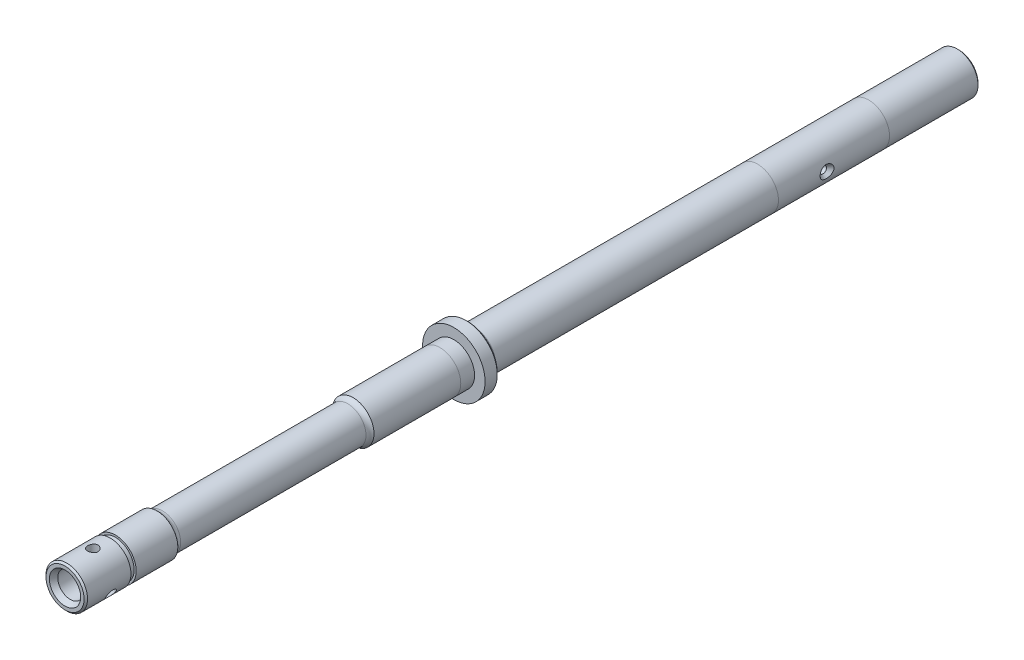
ISO-10303-21;
HEADER;
FILE_DESCRIPTION(('STEP AP214'),'2;1');
FILE_NAME('part.step','',(''),(''),'','','');
FILE_SCHEMA(('AUTOMOTIVE_DESIGN { 1 0 10303 214 1 1 1 1 }'));
ENDSEC;
DATA;
#1=APPLICATION_CONTEXT('core data for automotive mechanical design processes');
#2=APPLICATION_PROTOCOL_DEFINITION('international standard','automotive_design',2000,#1);
#3=PRODUCT_CONTEXT('',#1,'mechanical');
#4=PRODUCT('Part','Part','',(#3));
#5=PRODUCT_RELATED_PRODUCT_CATEGORY('part','',(#4));
#6=PRODUCT_DEFINITION_FORMATION('','',#4);
#7=PRODUCT_DEFINITION_CONTEXT('part definition',#1,'design');
#8=PRODUCT_DEFINITION('design','',#6,#7);
#9=PRODUCT_DEFINITION_SHAPE('','',#8);
#10=(LENGTH_UNIT() NAMED_UNIT(*) SI_UNIT(.MILLI.,.METRE.));
#11=(NAMED_UNIT(*) PLANE_ANGLE_UNIT() SI_UNIT($,.RADIAN.));
#12=(NAMED_UNIT(*) SI_UNIT($,.STERADIAN.) SOLID_ANGLE_UNIT());
#13=UNCERTAINTY_MEASURE_WITH_UNIT(LENGTH_MEASURE(1.E-05),#10,'distance_accuracy_value','');
#14=(GEOMETRIC_REPRESENTATION_CONTEXT(3) GLOBAL_UNCERTAINTY_ASSIGNED_CONTEXT((#13)) GLOBAL_UNIT_ASSIGNED_CONTEXT((#10,
#11,#12)) REPRESENTATION_CONTEXT('',''));
#15=CARTESIAN_POINT('',(0.,0.,0.));
#16=DIRECTION('',(0.,0.,1.));
#17=DIRECTION('',(1.,0.,0.));
#18=AXIS2_PLACEMENT_3D('',#15,#16,#17);
#19=CARTESIAN_POINT('',(0.,0.,-204.390625));
#20=DIRECTION('',(0.,0.,1.));
#21=DIRECTION('',(1.,0.,0.));
#22=AXIS2_PLACEMENT_3D('',#19,#20,#21);
#23=PLANE('',#22);
#24=CARTESIAN_POINT('',(0.,0.,-204.390625));
#25=DIRECTION('',(0.,0.,-1.));
#26=DIRECTION('',(-1.,0.,0.));
#27=AXIS2_PLACEMENT_3D('',#24,#25,#26);
#28=CIRCLE('',#27,6.35000000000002);
#29=CARTESIAN_POINT('',(-6.35000000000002,0.,-204.390625));
#30=VERTEX_POINT('',#29);
#31=EDGE_CURVE('E124',#30,#30,#28,.T.);
#32=ORIENTED_EDGE('',*,*,#31,.F.);
#33=EDGE_LOOP('',(#32));
#34=FACE_BOUND('',#33,.T.);
#35=CARTESIAN_POINT('',(0.,0.,-204.390625));
#36=DIRECTION('',(0.,0.,1.));
#37=DIRECTION('',(1.,0.,0.));
#38=AXIS2_PLACEMENT_3D('',#35,#36,#37);
#39=CIRCLE('',#38,8.70584999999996);
#40=CARTESIAN_POINT('',(8.70584999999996,0.,-204.390625));
#41=VERTEX_POINT('',#40);
#42=EDGE_CURVE('E43',#41,#41,#39,.F.);
#43=ORIENTED_EDGE('',*,*,#42,.T.);
#44=EDGE_LOOP('',(#43));
#45=FACE_BOUND('',#44,.T.);
#46=ADVANCED_FACE('F31',(#34,#45),#23,.F.);
#47=CARTESIAN_POINT('',(0.,0.,245.911499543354));
#48=DIRECTION('',(0.,0.,1.));
#49=DIRECTION('',(1.,0.,0.));
#50=AXIS2_PLACEMENT_3D('',#47,#48,#49);
#51=CYLINDRICAL_SURFACE('',#50,9.49959999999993);
#52=CARTESIAN_POINT('',(0.,0.,-203.596875));
#53=DIRECTION('',(0.,0.,1.));
#54=DIRECTION('',(1.,0.,0.));
#55=AXIS2_PLACEMENT_3D('',#52,#53,#54);
#56=CIRCLE('',#55,9.49959999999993);
#57=CARTESIAN_POINT('',(9.49959999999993,0.,-203.596875));
#58=VERTEX_POINT('',#57);
#59=EDGE_CURVE('E128',#58,#58,#56,.T.);
#60=ORIENTED_EDGE('',*,*,#59,.T.);
#61=EDGE_LOOP('',(#60));
#62=FACE_BOUND('',#61,.T.);
#63=CARTESIAN_POINT('',(0.,0.,-163.115625));
#64=DIRECTION('',(0.,0.,1.));
#65=DIRECTION('',(1.,0.,0.));
#66=AXIS2_PLACEMENT_3D('',#63,#64,#65);
#67=CIRCLE('',#66,9.49959999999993);
#68=CARTESIAN_POINT('',(9.49959999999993,0.,-163.115625));
#69=VERTEX_POINT('',#68);
#70=EDGE_CURVE('E150',#69,#69,#67,.T.);
#71=ORIENTED_EDGE('',*,*,#70,.F.);
#72=EDGE_LOOP('',(#71));
#73=FACE_BOUND('',#72,.T.);
#74=ADVANCED_FACE('F114',(#62,#73),#51,.T.);
#75=CARTESIAN_POINT('',(0.,9.49959999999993,-163.115625));
#76=DIRECTION('',(0.,0.,1.));
#77=DIRECTION('',(1.,0.,0.));
#78=AXIS2_PLACEMENT_3D('',#75,#76,#77);
#79=PLANE('',#78);
#80=CARTESIAN_POINT('',(0.,0.,-163.115625));
#81=DIRECTION('',(0.,0.,1.));
#82=DIRECTION('',(1.,0.,0.));
#83=AXIS2_PLACEMENT_3D('',#80,#81,#82);
#84=CIRCLE('',#83,9.52373);
#85=CARTESIAN_POINT('',(9.52373,0.,-163.115625));
#86=VERTEX_POINT('',#85);
#87=EDGE_CURVE('E162',#86,#86,#84,.T.);
#88=ORIENTED_EDGE('',*,*,#87,.F.);
#89=EDGE_LOOP('',(#88));
#90=FACE_BOUND('',#89,.T.);
#91=ORIENTED_EDGE('',*,*,#70,.T.);
#92=EDGE_LOOP('',(#91));
#93=FACE_BOUND('',#92,.T.);
#94=ADVANCED_FACE('F119',(#90,#93),#79,.F.);
#95=CARTESIAN_POINT('',(0.,0.,245.911499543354));
#96=DIRECTION('',(0.,0.,1.));
#97=DIRECTION('',(1.,0.,0.));
#98=AXIS2_PLACEMENT_3D('',#95,#96,#97);
#99=CYLINDRICAL_SURFACE('',#98,9.52373);
#100=CARTESIAN_POINT('',(9.29388406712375,-2.07970016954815,-136.666673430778));
#101=CARTESIAN_POINT('',(9.27290426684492,-2.17345940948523,-136.549442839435));
#102=CARTESIAN_POINT('',(9.252338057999,-2.25873304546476,-136.425338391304));
#103=CARTESIAN_POINT('',(9.21370426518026,-2.41149322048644,-136.166226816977));
#104=CARTESIAN_POINT('',(9.19563843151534,-2.47896732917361,-136.031212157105));
#105=CARTESIAN_POINT('',(9.16004715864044,-2.60775247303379,-135.723586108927));
#106=CARTESIAN_POINT('',(9.14343883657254,-2.66476424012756,-135.549049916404));
#107=CARTESIAN_POINT('',(9.11791294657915,-2.75083946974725,-135.192652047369));
#108=CARTESIAN_POINT('',(9.10899843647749,-2.77989182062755,-135.010787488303));
#109=CARTESIAN_POINT('',(9.09973178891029,-2.8100883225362,-134.637826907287));
#110=CARTESIAN_POINT('',(9.09970365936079,-2.81017640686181,-134.4466360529));
#111=CARTESIAN_POINT('',(9.10903521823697,-2.77977537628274,-134.066933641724));
#112=CARTESIAN_POINT('',(9.11839536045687,-2.74928478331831,-133.878422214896));
#113=CARTESIAN_POINT('',(9.14538914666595,-2.65810902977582,-133.508744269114));
#114=CARTESIAN_POINT('',(9.16305184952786,-2.59731777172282,-133.327605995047));
#115=CARTESIAN_POINT('',(9.20448367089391,-2.44642799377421,-132.978627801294));
#116=CARTESIAN_POINT('',(9.22825432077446,-2.35632212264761,-132.810791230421));
#117=CARTESIAN_POINT('',(9.27856301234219,-2.14961258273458,-132.496162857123));
#118=CARTESIAN_POINT('',(9.30505697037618,-2.03340329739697,-132.349106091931));
#119=CARTESIAN_POINT('',(9.35766420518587,-1.77560849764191,-132.079001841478));
#120=CARTESIAN_POINT('',(9.38377766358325,-1.63403554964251,-131.955942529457));
#121=CARTESIAN_POINT('',(9.42983074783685,-1.34153938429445,-131.749326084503));
#122=CARTESIAN_POINT('',(9.45010554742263,-1.19241602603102,-131.663310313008));
#123=CARTESIAN_POINT('',(9.48431454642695,-0.879652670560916,-131.521912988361));
#124=CARTESIAN_POINT('',(9.49825824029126,-0.716034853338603,-131.466485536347));
#125=CARTESIAN_POINT('',(9.51621694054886,-0.404695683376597,-131.395775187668));
#126=CARTESIAN_POINT('',(9.5213740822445,-0.258086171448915,-131.375854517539));
#127=CARTESIAN_POINT('',(9.52479569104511,0.0363893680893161,-131.362598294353));
#128=CARTESIAN_POINT('',(9.52306366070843,0.184254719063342,-131.3692492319));
#129=CARTESIAN_POINT('',(9.51337755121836,0.463652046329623,-131.406977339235));
#130=CARTESIAN_POINT('',(9.50596782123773,0.595500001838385,-131.4359186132));
#131=CARTESIAN_POINT('',(9.48636551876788,0.852604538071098,-131.514151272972));
#132=CARTESIAN_POINT('',(9.47417246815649,0.977860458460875,-131.563444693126));
#133=CARTESIAN_POINT('',(9.44562167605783,1.22376299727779,-131.682505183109));
#134=CARTESIAN_POINT('',(9.42912061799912,1.34404184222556,-131.752992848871));
#135=CARTESIAN_POINT('',(9.3937278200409,1.57248162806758,-131.910910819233));
#136=CARTESIAN_POINT('',(9.37483510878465,1.68063761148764,-131.998348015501));
#137=CARTESIAN_POINT('',(9.33387096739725,1.89570244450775,-132.198977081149));
#138=CARTESIAN_POINT('',(9.31169155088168,2.00087628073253,-132.314005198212));
#139=CARTESIAN_POINT('',(9.26834014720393,2.19294710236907,-132.558584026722));
#140=CARTESIAN_POINT('',(9.2471687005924,2.279834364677,-132.688142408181));
#141=CARTESIAN_POINT('',(9.20518419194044,2.44420130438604,-132.975757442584));
#142=CARTESIAN_POINT('',(9.18475433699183,2.51910558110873,-133.135346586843));
#143=CARTESIAN_POINT('',(9.14970007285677,2.6435985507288,-133.464712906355));
#144=CARTESIAN_POINT('',(9.13507746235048,2.69317940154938,-133.634493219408));
#145=CARTESIAN_POINT('',(9.11246557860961,2.7687723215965,-133.991683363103));
#146=CARTESIAN_POINT('',(9.10498802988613,2.79297691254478,-134.1795112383));
#147=CARTESIAN_POINT('',(9.09934929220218,2.81129245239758,-134.556768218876));
#148=CARTESIAN_POINT('',(9.10118895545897,2.80540064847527,-134.746197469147));
#149=CARTESIAN_POINT('',(9.11403681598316,2.76337682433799,-135.123686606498));
#150=CARTESIAN_POINT('',(9.12515545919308,2.72688049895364,-135.311702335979));
#151=CARTESIAN_POINT('',(9.15532571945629,2.62379612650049,-135.678680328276));
#152=CARTESIAN_POINT('',(9.17437892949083,2.55720203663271,-135.857640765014));
#153=CARTESIAN_POINT('',(9.21798201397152,2.39525105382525,-136.200558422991));
#154=CARTESIAN_POINT('',(9.24251191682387,2.29999824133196,-136.36456718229));
#155=CARTESIAN_POINT('',(9.29404352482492,2.08199272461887,-136.672876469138));
#156=CARTESIAN_POINT('',(9.32104522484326,1.95924007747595,-136.817177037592));
#157=CARTESIAN_POINT('',(9.37258182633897,1.6950847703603,-137.073452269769));
#158=CARTESIAN_POINT('',(9.39717261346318,1.55491470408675,-137.186678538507));
#159=CARTESIAN_POINT('',(9.44192490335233,1.25473609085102,-137.383981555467));
#160=CARTESIAN_POINT('',(9.46209226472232,1.09475422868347,-137.46809694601));
#161=CARTESIAN_POINT('',(9.49268940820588,0.782069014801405,-137.592804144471));
#162=CARTESIAN_POINT('',(9.50404873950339,0.631157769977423,-137.63765412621));
#163=CARTESIAN_POINT('',(9.51948427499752,0.323265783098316,-137.698187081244));
#164=CARTESIAN_POINT('',(9.52356777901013,0.166291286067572,-137.713899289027));
#165=CARTESIAN_POINT('',(9.5238636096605,-0.128246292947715,-137.715032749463));
#166=CARTESIAN_POINT('',(9.52098737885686,-0.265807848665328,-137.703961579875));
#167=CARTESIAN_POINT('',(9.5095485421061,-0.536959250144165,-137.65928404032));
#168=CARTESIAN_POINT('',(9.50098600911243,-0.670549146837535,-137.625677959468));
#169=CARTESIAN_POINT('',(9.47920843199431,-0.928810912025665,-137.538135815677));
#170=CARTESIAN_POINT('',(9.4660440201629,-1.05356274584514,-137.484420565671));
#171=CARTESIAN_POINT('',(9.43630361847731,-1.29313412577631,-137.358939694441));
#172=CARTESIAN_POINT('',(9.4197272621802,-1.40795260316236,-137.287172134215));
#173=CARTESIAN_POINT('',(9.38513029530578,-1.62240638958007,-137.130602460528));
#174=CARTESIAN_POINT('',(9.36717160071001,-1.72240595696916,-137.046281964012));
#175=CARTESIAN_POINT('',(9.3306658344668,-1.91030758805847,-136.865263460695));
#176=CARTESIAN_POINT('',(9.31211873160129,-1.99820900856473,-136.768564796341));
#177=CARTESIAN_POINT('',(9.29388406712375,-2.07970016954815,-136.666673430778));
#178=B_SPLINE_CURVE_WITH_KNOTS('',3,(#100,#101,#102,#103,#104,#105,#106,#107,#108,#109,#110,
#111,#112,#113,#114,#115,#116,#117,#118,#119,#120,#121,#122,#123,#124,#125,#126,#127,#128,#129,
#130,#131,#132,#133,#134,#135,#136,#137,#138,#139,#140,#141,#142,#143,#144,#145,#146,#147,#148,
#149,#150,#151,#152,#153,#154,#155,#156,#157,#158,#159,#160,#161,#162,#163,#164,#165,#166,#167,
#168,#169,#170,#171,#172,#173,#174,#175,#176,#177),.UNSPECIFIED.,.T.,.F.,(4,2,2,2,2,2,2,2,2,2,2,
2,2,2,2,2,2,2,2,2,2,2,2,2,2,2,2,2,2,2,2,2,2,2,2,2,2,2,4),(0.,0.45437014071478,0.90905675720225,
1.45961455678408,2.01039106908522,2.58124730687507,3.15213113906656,3.72502810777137,
4.29806885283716,4.86297348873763,5.42759901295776,5.9445324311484,6.46068804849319,
6.9023826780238,7.34385277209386,7.74759732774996,8.15138225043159,8.57084437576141,
8.99047741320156,9.4608952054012,9.93156249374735,10.4616934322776,10.9919884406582,
11.5579150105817,12.1238933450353,12.6967061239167,13.2696339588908,13.8405056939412,
14.4113762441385,14.9538286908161,15.4955582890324,15.9663190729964,16.4366072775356,
16.8487028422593,17.2607931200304,17.6684851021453,18.0762208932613,18.4711172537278,
18.866034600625),.UNSPECIFIED.);
#179=CARTESIAN_POINT('',(9.29388406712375,-2.07970016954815,-136.666673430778));
#180=VERTEX_POINT('',#179);
#181=EDGE_CURVE('E56',#180,#180,#178,.T.);
#182=ORIENTED_EDGE('',*,*,#181,.T.);
#183=EDGE_LOOP('',(#182));
#184=FACE_BOUND('',#183,.T.);
#185=CARTESIAN_POINT('',(-9.29388406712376,-2.07970016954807,-136.666673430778));
#186=CARTESIAN_POINT('',(-9.31491759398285,-1.98569668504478,-136.784211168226));
#187=CARTESIAN_POINT('',(-9.33636711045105,-1.88317235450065,-136.894824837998));
#188=CARTESIAN_POINT('',(-9.3782287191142,-1.66219581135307,-137.099166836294));
#189=CARTESIAN_POINT('',(-9.39864082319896,-1.54374378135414,-137.192895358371));
#190=CARTESIAN_POINT('',(-9.43847683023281,-1.27918156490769,-137.369037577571));
#191=CARTESIAN_POINT('',(-9.45755865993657,-1.13146700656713,-137.449152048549));
#192=CARTESIAN_POINT('',(-9.4893841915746,-0.822782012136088,-137.579676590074));
#193=CARTESIAN_POINT('',(-9.50213320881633,-0.661822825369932,-137.630111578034));
#194=CARTESIAN_POINT('',(-9.51821481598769,-0.354322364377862,-137.693232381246));
#195=CARTESIAN_POINT('',(-9.52256544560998,-0.208669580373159,-137.710011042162));
#196=CARTESIAN_POINT('',(-9.52448202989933,0.0833102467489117,-137.717434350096));
#197=CARTESIAN_POINT('',(-9.52205153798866,0.229636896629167,-137.7080926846));
#198=CARTESIAN_POINT('',(-9.51117003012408,0.506791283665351,-137.665635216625));
#199=CARTESIAN_POINT('',(-9.50320297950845,0.637938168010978,-137.63442896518));
#200=CARTESIAN_POINT('',(-9.48260638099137,0.8933277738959,-137.551915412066));
#201=CARTESIAN_POINT('',(-9.4699762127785,1.01756957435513,-137.500605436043));
#202=CARTESIAN_POINT('',(-9.4405958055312,1.26191048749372,-137.377360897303));
#203=CARTESIAN_POINT('',(-9.42368599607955,1.3815729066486,-137.304603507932));
#204=CARTESIAN_POINT('',(-9.38762223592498,1.60847978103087,-137.142277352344));
#205=CARTESIAN_POINT('',(-9.36846734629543,1.71571900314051,-137.052701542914));
#206=CARTESIAN_POINT('',(-9.3270769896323,1.92879965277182,-136.84747391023));
#207=CARTESIAN_POINT('',(-9.30475294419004,2.03283758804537,-136.729968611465));
#208=CARTESIAN_POINT('',(-9.26133932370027,2.22227114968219,-136.480589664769));
#209=CARTESIAN_POINT('',(-9.24025040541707,2.30765692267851,-136.348708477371));
#210=CARTESIAN_POINT('',(-9.19872910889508,2.46831081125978,-136.056619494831));
#211=CARTESIAN_POINT('',(-9.17870501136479,2.54099759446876,-135.894928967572));
#212=CARTESIAN_POINT('',(-9.14472446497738,2.66070065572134,-135.56170634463));
#213=CARTESIAN_POINT('',(-9.13076978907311,2.70770943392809,-135.39017138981));
#214=CARTESIAN_POINT('',(-9.10979182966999,2.77751194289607,-135.030450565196));
#215=CARTESIAN_POINT('',(-9.10326396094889,2.79858192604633,-134.84189844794));
#216=CARTESIAN_POINT('',(-9.09958637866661,2.81051532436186,-134.463747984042));
#217=CARTESIAN_POINT('',(-9.10243751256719,2.80137600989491,-134.274149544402));
#218=CARTESIAN_POINT('',(-9.11724518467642,2.75280213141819,-133.897195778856));
#219=CARTESIAN_POINT('',(-9.12929710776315,2.71305016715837,-133.709884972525));
#220=CARTESIAN_POINT('',(-9.16112580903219,2.60354291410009,-133.34488170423));
#221=CARTESIAN_POINT('',(-9.18090420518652,2.53378134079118,-133.167191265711));
#222=CARTESIAN_POINT('',(-9.22563572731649,2.36571052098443,-132.827540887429));
#223=CARTESIAN_POINT('',(-9.2505650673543,2.26753169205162,-132.665513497));
#224=CARTESIAN_POINT('',(-9.30252884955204,2.04389946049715,-132.361746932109));
#225=CARTESIAN_POINT('',(-9.32956318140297,1.91844748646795,-132.220006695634));
#226=CARTESIAN_POINT('',(-9.38065753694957,1.6499462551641,-131.969897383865));
#227=CARTESIAN_POINT('',(-9.40479934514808,1.50821542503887,-131.860138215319));
#228=CARTESIAN_POINT('',(-9.44834748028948,1.20556195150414,-131.67008055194));
#229=CARTESIAN_POINT('',(-9.46776030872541,1.04466611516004,-131.58974153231));
#230=CARTESIAN_POINT('',(-9.49671695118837,0.731520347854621,-131.472406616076));
#231=CARTESIAN_POINT('',(-9.50723405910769,0.580996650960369,-131.431048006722));
#232=CARTESIAN_POINT('',(-9.52100091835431,0.274577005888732,-131.377198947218));
#233=CARTESIAN_POINT('',(-9.5242574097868,0.118686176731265,-131.364681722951));
#234=CARTESIAN_POINT('',(-9.5231311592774,-0.173900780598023,-131.369051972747));
#235=CARTESIAN_POINT('',(-9.51961550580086,-0.310662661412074,-131.382601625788));
#236=CARTESIAN_POINT('',(-9.50701728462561,-0.579829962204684,-131.431913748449));
#237=CARTESIAN_POINT('',(-9.49793488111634,-0.712235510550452,-131.467675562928));
#238=CARTESIAN_POINT('',(-9.47520320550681,-0.9687652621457,-131.559431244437));
#239=CARTESIAN_POINT('',(-9.46157178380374,-1.09291959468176,-131.615346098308));
#240=CARTESIAN_POINT('',(-9.43102564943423,-1.33102237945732,-131.74506374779));
#241=CARTESIAN_POINT('',(-9.41410993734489,-1.44496770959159,-131.818871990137));
#242=CARTESIAN_POINT('',(-9.37662920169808,-1.67175786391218,-131.990066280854));
#243=CARTESIAN_POINT('',(-9.35586827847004,-1.78334151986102,-132.089076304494));
#244=CARTESIAN_POINT('',(-9.31399076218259,-1.99052862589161,-132.30251823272));
#245=CARTESIAN_POINT('',(-9.29287398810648,-2.08612365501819,-132.416958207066));
#246=CARTESIAN_POINT('',(-9.24932056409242,-2.27196091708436,-132.674467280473));
#247=CARTESIAN_POINT('',(-9.22708410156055,-2.35978453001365,-132.819318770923));
#248=CARTESIAN_POINT('',(-9.1866623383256,-2.51255315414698,-133.121146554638));
#249=CARTESIAN_POINT('',(-9.16847875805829,-2.57748845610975,-133.278127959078));
#250=CARTESIAN_POINT('',(-9.13656267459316,-2.6885558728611,-133.615297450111));
#251=CARTESIAN_POINT('',(-9.12339237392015,-2.73241322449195,-133.796292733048));
#252=CARTESIAN_POINT('',(-9.10559245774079,-2.79115849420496,-134.163324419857));
#253=CARTESIAN_POINT('',(-9.10096355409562,-2.80604399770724,-134.349361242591));
#254=CARTESIAN_POINT('',(-9.100796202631,-2.80659128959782,-134.726340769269));
#255=CARTESIAN_POINT('',(-9.10549715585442,-2.79148345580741,-134.91728530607));
#256=CARTESIAN_POINT('',(-9.12389134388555,-2.73075588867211,-135.293890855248));
#257=CARTESIAN_POINT('',(-9.13758821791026,-2.68512380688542,-135.479549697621));
#258=CARTESIAN_POINT('',(-9.17248381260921,-2.56339931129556,-135.842340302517));
#259=CARTESIAN_POINT('',(-9.19376949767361,-2.4869523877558,-136.019344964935));
#260=CARTESIAN_POINT('',(-9.24111044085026,-2.30480451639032,-136.356840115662));
#261=CARTESIAN_POINT('',(-9.26716152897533,-2.19912910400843,-136.517344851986));
#262=CARTESIAN_POINT('',(-9.29388406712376,-2.07970016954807,-136.666673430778));
#263=B_SPLINE_CURVE_WITH_KNOTS('',3,(#185,#186,#187,#188,#189,#190,#191,#192,#193,#194,#195,
#196,#197,#198,#199,#200,#201,#202,#203,#204,#205,#206,#207,#208,#209,#210,#211,#212,#213,#214,
#215,#216,#217,#218,#219,#220,#221,#222,#223,#224,#225,#226,#227,#228,#229,#230,#231,#232,#233,
#234,#235,#236,#237,#238,#239,#240,#241,#242,#243,#244,#245,#246,#247,#248,#249,#250,#251,#252,
#253,#254,#255,#256,#257,#258,#259,#260,#261,#262),.UNSPECIFIED.,.T.,.F.,(4,2,2,2,2,2,2,2,2,2,2,
2,2,2,2,2,2,2,2,2,2,2,2,2,2,2,2,2,2,2,2,2,2,2,2,2,2,2,4),(0.,0.455405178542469,
0.910805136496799,1.41515671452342,1.91908425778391,2.35672548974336,2.79413743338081,
3.19746013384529,3.60083650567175,4.02233012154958,4.44400064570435,4.91767523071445,
5.39159944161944,5.92449977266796,6.45755566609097,7.02439951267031,7.59129457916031,
8.16414783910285,8.73712112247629,9.3075054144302,9.87785983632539,10.4173719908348,
10.9561381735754,11.4227763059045,11.8889810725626,12.2994265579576,12.709859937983,
13.1187013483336,13.5276673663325,13.9777292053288,14.4280273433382,14.9384447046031,
15.4490783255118,16.0066114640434,16.5641910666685,17.1362629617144,17.7085664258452,
18.2876509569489,18.8662311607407),.UNSPECIFIED.);
#264=CARTESIAN_POINT('',(-9.29388406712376,-2.07970016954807,-136.666673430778));
#265=VERTEX_POINT('',#264);
#266=EDGE_CURVE('E47',#265,#265,#263,.T.);
#267=ORIENTED_EDGE('',*,*,#266,.T.);
#268=EDGE_LOOP('',(#267));
#269=FACE_BOUND('',#268,.T.);
#270=CARTESIAN_POINT('',(0.,0.,-112.315625));
#271=DIRECTION('',(0.,0.,1.));
#272=DIRECTION('',(1.,0.,0.));
#273=AXIS2_PLACEMENT_3D('',#270,#271,#272);
#274=CIRCLE('',#273,9.52372999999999);
#275=CARTESIAN_POINT('',(9.52372999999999,0.,-112.315625));
#276=VERTEX_POINT('',#275);
#277=EDGE_CURVE('E165',#276,#276,#274,.T.);
#278=ORIENTED_EDGE('',*,*,#277,.F.);
#279=EDGE_LOOP('',(#278));
#280=FACE_BOUND('',#279,.T.);
#281=ORIENTED_EDGE('',*,*,#87,.T.);
#282=EDGE_LOOP('',(#281));
#283=FACE_BOUND('',#282,.T.);
#284=ADVANCED_FACE('F60',(#184,#269,#280,#283),#99,.T.);
#285=CARTESIAN_POINT('',(0.,9.52372999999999,-112.315625));
#286=DIRECTION('',(0.,0.,1.));
#287=DIRECTION('',(1.,0.,0.));
#288=AXIS2_PLACEMENT_3D('',#285,#286,#287);
#289=PLANE('',#288);
#290=CARTESIAN_POINT('',(0.,0.,-112.315625));
#291=DIRECTION('',(0.,0.,1.));
#292=DIRECTION('',(1.,0.,0.));
#293=AXIS2_PLACEMENT_3D('',#290,#291,#292);
#294=CIRCLE('',#293,9.525);
#295=CARTESIAN_POINT('',(9.525,0.,-112.315625));
#296=VERTEX_POINT('',#295);
#297=EDGE_CURVE('E168',#296,#296,#294,.T.);
#298=ORIENTED_EDGE('',*,*,#297,.F.);
#299=EDGE_LOOP('',(#298));
#300=FACE_BOUND('',#299,.T.);
#301=ORIENTED_EDGE('',*,*,#277,.T.);
#302=EDGE_LOOP('',(#301));
#303=FACE_BOUND('',#302,.T.);
#304=ADVANCED_FACE('F301',(#300,#303),#289,.F.);
#305=CARTESIAN_POINT('',(0.,0.,245.911499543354));
#306=DIRECTION('',(0.,0.,1.));
#307=DIRECTION('',(1.,0.,0.));
#308=AXIS2_PLACEMENT_3D('',#305,#306,#307);
#309=CYLINDRICAL_SURFACE('',#308,9.52499999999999);
#310=CARTESIAN_POINT('',(0.,0.,17.065625));
#311=DIRECTION('',(0.,0.,1.));
#312=DIRECTION('',(1.,0.,0.));
#313=AXIS2_PLACEMENT_3D('',#310,#311,#312);
#314=CIRCLE('',#313,9.52499999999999);
#315=CARTESIAN_POINT('',(9.52499999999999,0.,17.065625));
#316=VERTEX_POINT('',#315);
#317=EDGE_CURVE('E138',#316,#316,#314,.F.);
#318=ORIENTED_EDGE('',*,*,#317,.T.);
#319=EDGE_LOOP('',(#318));
#320=FACE_BOUND('',#319,.T.);
#321=ORIENTED_EDGE('',*,*,#297,.T.);
#322=EDGE_LOOP('',(#321));
#323=FACE_BOUND('',#322,.T.);
#324=ADVANCED_FACE('F298',(#320,#323),#309,.T.);
#325=CARTESIAN_POINT('',(0.,9.52499999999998,20.240625));
#326=DIRECTION('',(0.,0.,1.));
#327=DIRECTION('',(1.,0.,0.));
#328=AXIS2_PLACEMENT_3D('',#325,#326,#327);
#329=PLANE('',#328);
#330=CARTESIAN_POINT('',(0.,0.,20.240625));
#331=DIRECTION('',(0.,0.,1.));
#332=DIRECTION('',(1.,0.,0.));
#333=AXIS2_PLACEMENT_3D('',#330,#331,#332);
#334=CIRCLE('',#333,13.4937499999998);
#335=CARTESIAN_POINT('',(13.4937499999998,0.,20.240625));
#336=VERTEX_POINT('',#335);
#337=EDGE_CURVE('E130',#336,#336,#334,.F.);
#338=ORIENTED_EDGE('',*,*,#337,.T.);
#339=EDGE_LOOP('',(#338));
#340=FACE_BOUND('',#339,.T.);
#341=CARTESIAN_POINT('',(0.,0.,20.240625));
#342=DIRECTION('',(0.,0.,1.));
#343=DIRECTION('',(1.,0.,0.));
#344=AXIS2_PLACEMENT_3D('',#341,#342,#343);
#345=CIRCLE('',#344,12.7);
#346=CARTESIAN_POINT('',(12.7,0.,20.240625));
#347=VERTEX_POINT('',#346);
#348=EDGE_CURVE('E141',#347,#347,#345,.T.);
#349=ORIENTED_EDGE('',*,*,#348,.T.);
#350=EDGE_LOOP('',(#349));
#351=FACE_BOUND('',#350,.T.);
#352=ADVANCED_FACE('F294',(#340,#351),#329,.F.);
#353=CARTESIAN_POINT('',(0.,0.,245.911499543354));
#354=DIRECTION('',(0.,0.,1.));
#355=DIRECTION('',(1.,0.,0.));
#356=AXIS2_PLACEMENT_3D('',#353,#354,#355);
#357=CYLINDRICAL_SURFACE('',#356,14.2874999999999);
#358=CARTESIAN_POINT('',(0.,0.,21.0343750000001));
#359=DIRECTION('',(0.,0.,1.));
#360=DIRECTION('',(1.,0.,0.));
#361=AXIS2_PLACEMENT_3D('',#358,#359,#360);
#362=CIRCLE('',#361,14.2874999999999);
#363=CARTESIAN_POINT('',(14.2874999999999,0.,21.0343750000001));
#364=VERTEX_POINT('',#363);
#365=EDGE_CURVE('E135',#364,#364,#362,.T.);
#366=ORIENTED_EDGE('',*,*,#365,.T.);
#367=EDGE_LOOP('',(#366));
#368=FACE_BOUND('',#367,.T.);
#369=CARTESIAN_POINT('',(0.,0.,26.590625));
#370=DIRECTION('',(0.,0.,1.));
#371=DIRECTION('',(1.,0.,0.));
#372=AXIS2_PLACEMENT_3D('',#369,#370,#371);
#373=CIRCLE('',#372,14.2874999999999);
#374=CARTESIAN_POINT('',(14.2874999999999,0.,26.590625));
#375=VERTEX_POINT('',#374);
#376=EDGE_CURVE('E171',#375,#375,#373,.T.);
#377=ORIENTED_EDGE('',*,*,#376,.F.);
#378=EDGE_LOOP('',(#377));
#379=FACE_BOUND('',#378,.T.);
#380=ADVANCED_FACE('F290',(#368,#379),#357,.T.);
#381=CARTESIAN_POINT('',(0.,14.2874999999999,26.590625));
#382=DIRECTION('',(0.,0.,-1.));
#383=DIRECTION('',(-1.,0.,0.));
#384=AXIS2_PLACEMENT_3D('',#381,#382,#383);
#385=PLANE('',#384);
#386=CARTESIAN_POINT('',(0.,0.,26.590625));
#387=DIRECTION('',(0.,0.,1.));
#388=DIRECTION('',(1.,0.,0.));
#389=AXIS2_PLACEMENT_3D('',#386,#387,#388);
#390=CIRCLE('',#389,9.48690000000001);
#391=CARTESIAN_POINT('',(9.48690000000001,0.,26.590625));
#392=VERTEX_POINT('',#391);
#393=EDGE_CURVE('E174',#392,#392,#390,.T.);
#394=ORIENTED_EDGE('',*,*,#393,.F.);
#395=EDGE_LOOP('',(#394));
#396=FACE_BOUND('',#395,.T.);
#397=ORIENTED_EDGE('',*,*,#376,.T.);
#398=EDGE_LOOP('',(#397));
#399=FACE_BOUND('',#398,.T.);
#400=ADVANCED_FACE('F286',(#396,#399),#385,.F.);
#401=CARTESIAN_POINT('',(0.,0.,245.911499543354));
#402=DIRECTION('',(0.,0.,1.));
#403=DIRECTION('',(1.,0.,0.));
#404=AXIS2_PLACEMENT_3D('',#401,#402,#403);
#405=CYLINDRICAL_SURFACE('',#404,9.48690000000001);
#406=CARTESIAN_POINT('',(0.,0.,32.940625));
#407=DIRECTION('',(0.,0.,1.));
#408=DIRECTION('',(1.,0.,0.));
#409=AXIS2_PLACEMENT_3D('',#406,#407,#408);
#410=CIRCLE('',#409,9.48690000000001);
#411=CARTESIAN_POINT('',(9.48690000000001,0.,32.940625));
#412=VERTEX_POINT('',#411);
#413=EDGE_CURVE('E177',#412,#412,#410,.T.);
#414=ORIENTED_EDGE('',*,*,#413,.F.);
#415=EDGE_LOOP('',(#414));
#416=FACE_BOUND('',#415,.T.);
#417=ORIENTED_EDGE('',*,*,#393,.T.);
#418=EDGE_LOOP('',(#417));
#419=FACE_BOUND('',#418,.T.);
#420=ADVANCED_FACE('F282',(#416,#419),#405,.T.);
#421=CARTESIAN_POINT('',(0.,9.48690000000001,32.940625));
#422=DIRECTION('',(0.,0.,1.));
#423=DIRECTION('',(1.,0.,0.));
#424=AXIS2_PLACEMENT_3D('',#421,#422,#423);
#425=PLANE('',#424);
#426=CARTESIAN_POINT('',(0.,0.,32.940625));
#427=DIRECTION('',(0.,0.,1.));
#428=DIRECTION('',(1.,0.,0.));
#429=AXIS2_PLACEMENT_3D('',#426,#427,#428);
#430=CIRCLE('',#429,9.50976000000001);
#431=CARTESIAN_POINT('',(9.50976000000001,0.,32.940625));
#432=VERTEX_POINT('',#431);
#433=EDGE_CURVE('E180',#432,#432,#430,.T.);
#434=ORIENTED_EDGE('',*,*,#433,.F.);
#435=EDGE_LOOP('',(#434));
#436=FACE_BOUND('',#435,.T.);
#437=ORIENTED_EDGE('',*,*,#413,.T.);
#438=EDGE_LOOP('',(#437));
#439=FACE_BOUND('',#438,.T.);
#440=ADVANCED_FACE('F278',(#436,#439),#425,.F.);
#441=CARTESIAN_POINT('',(0.,0.,245.911499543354));
#442=DIRECTION('',(0.,0.,1.));
#443=DIRECTION('',(1.,0.,0.));
#444=AXIS2_PLACEMENT_3D('',#441,#442,#443);
#445=CYLINDRICAL_SURFACE('',#444,9.50976000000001);
#446=CARTESIAN_POINT('',(0.,0.,72.628125));
#447=DIRECTION('',(0.,0.,1.));
#448=DIRECTION('',(1.,0.,0.));
#449=AXIS2_PLACEMENT_3D('',#446,#447,#448);
#450=CIRCLE('',#449,9.50976);
#451=CARTESIAN_POINT('',(9.50976,0.,72.628125));
#452=VERTEX_POINT('',#451);
#453=EDGE_CURVE('E183',#452,#452,#450,.T.);
#454=ORIENTED_EDGE('',*,*,#453,.F.);
#455=EDGE_LOOP('',(#454));
#456=FACE_BOUND('',#455,.T.);
#457=ORIENTED_EDGE('',*,*,#433,.T.);
#458=EDGE_LOOP('',(#457));
#459=FACE_BOUND('',#458,.T.);
#460=ADVANCED_FACE('F270',(#456,#459),#445,.T.);
#461=CARTESIAN_POINT('',(0.,0.,245.911499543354));
#462=DIRECTION('',(0.,0.,1.));
#463=DIRECTION('',(1.,0.,0.));
#464=AXIS2_PLACEMENT_3D('',#461,#462,#463);
#465=CYLINDRICAL_SURFACE('',#464,8.3312);
#466=CARTESIAN_POINT('',(0.,0.,159.853099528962));
#467=DIRECTION('',(0.,0.,1.));
#468=DIRECTION('',(1.,0.,0.));
#469=AXIS2_PLACEMENT_3D('',#466,#467,#468);
#470=CIRCLE('',#469,8.3312);
#471=CARTESIAN_POINT('',(8.3312,0.,159.853099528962));
#472=VERTEX_POINT('',#471);
#473=EDGE_CURVE('E144',#472,#472,#470,.F.);
#474=ORIENTED_EDGE('',*,*,#473,.T.);
#475=EDGE_LOOP('',(#474));
#476=FACE_BOUND('',#475,.T.);
#477=CARTESIAN_POINT('',(0.,0.,75.0969004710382));
#478=DIRECTION('',(0.,0.,-1.));
#479=DIRECTION('',(-1.,0.,0.));
#480=AXIS2_PLACEMENT_3D('',#477,#478,#479);
#481=CIRCLE('',#480,8.3312);
#482=CARTESIAN_POINT('',(-8.3312,0.,75.0969004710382));
#483=VERTEX_POINT('',#482);
#484=EDGE_CURVE('E147',#483,#483,#481,.F.);
#485=ORIENTED_EDGE('',*,*,#484,.T.);
#486=EDGE_LOOP('',(#485));
#487=FACE_BOUND('',#486,.T.);
#488=ADVANCED_FACE('F260',(#476,#487),#465,.T.);
#489=CARTESIAN_POINT('',(0.,0.,245.911499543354));
#490=DIRECTION('',(0.,0.,1.));
#491=DIRECTION('',(1.,0.,0.));
#492=AXIS2_PLACEMENT_3D('',#489,#490,#491);
#493=CYLINDRICAL_SURFACE('',#492,9.50976000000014);
#494=CARTESIAN_POINT('',(0.,0.,181.371875));
#495=DIRECTION('',(0.,0.,1.));
#496=DIRECTION('',(1.,0.,0.));
#497=AXIS2_PLACEMENT_3D('',#494,#495,#496);
#498=CIRCLE('',#497,9.50976000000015);
#499=CARTESIAN_POINT('',(9.50976000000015,0.,181.371875));
#500=VERTEX_POINT('',#499);
#501=EDGE_CURVE('E189',#500,#500,#498,.T.);
#502=ORIENTED_EDGE('',*,*,#501,.F.);
#503=EDGE_LOOP('',(#502));
#504=FACE_BOUND('',#503,.T.);
#505=CARTESIAN_POINT('',(0.,0.,162.321875));
#506=DIRECTION('',(0.,0.,1.));
#507=DIRECTION('',(1.,0.,0.));
#508=AXIS2_PLACEMENT_3D('',#505,#506,#507);
#509=CIRCLE('',#508,9.50976000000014);
#510=CARTESIAN_POINT('',(9.50976000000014,0.,162.321875));
#511=VERTEX_POINT('',#510);
#512=EDGE_CURVE('E186',#511,#511,#509,.T.);
#513=ORIENTED_EDGE('',*,*,#512,.T.);
#514=EDGE_LOOP('',(#513));
#515=FACE_BOUND('',#514,.T.);
#516=ADVANCED_FACE('F257',(#504,#515),#493,.T.);
#517=CARTESIAN_POINT('',(0.,9.50976000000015,181.371875));
#518=DIRECTION('',(0.,0.,-1.));
#519=DIRECTION('',(-1.,0.,0.));
#520=AXIS2_PLACEMENT_3D('',#517,#518,#519);
#521=PLANE('',#520);
#522=CARTESIAN_POINT('',(0.,0.,181.371875));
#523=DIRECTION('',(0.,0.,1.));
#524=DIRECTION('',(1.,0.,0.));
#525=AXIS2_PLACEMENT_3D('',#522,#523,#524);
#526=CIRCLE('',#525,8.5852);
#527=CARTESIAN_POINT('',(8.5852,0.,181.371875));
#528=VERTEX_POINT('',#527);
#529=EDGE_CURVE('E192',#528,#528,#526,.T.);
#530=ORIENTED_EDGE('',*,*,#529,.F.);
#531=EDGE_LOOP('',(#530));
#532=FACE_BOUND('',#531,.T.);
#533=ORIENTED_EDGE('',*,*,#501,.T.);
#534=EDGE_LOOP('',(#533));
#535=FACE_BOUND('',#534,.T.);
#536=ADVANCED_FACE('F259',(#532,#535),#521,.F.);
#537=CARTESIAN_POINT('',(0.,0.,245.911499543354));
#538=DIRECTION('',(0.,0.,1.));
#539=DIRECTION('',(1.,0.,0.));
#540=AXIS2_PLACEMENT_3D('',#537,#538,#539);
#541=CYLINDRICAL_SURFACE('',#540,8.5852);
#542=CARTESIAN_POINT('',(0.,0.,183.225195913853));
#543=DIRECTION('',(0.,0.,1.));
#544=DIRECTION('',(1.,0.,0.));
#545=AXIS2_PLACEMENT_3D('',#542,#543,#544);
#546=CIRCLE('',#545,8.5852);
#547=CARTESIAN_POINT('',(8.5852,0.,183.225195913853));
#548=VERTEX_POINT('',#547);
#549=EDGE_CURVE('E195',#548,#548,#546,.T.);
#550=ORIENTED_EDGE('',*,*,#549,.F.);
#551=EDGE_LOOP('',(#550));
#552=FACE_BOUND('',#551,.T.);
#553=ORIENTED_EDGE('',*,*,#529,.T.);
#554=EDGE_LOOP('',(#553));
#555=FACE_BOUND('',#554,.T.);
#556=ADVANCED_FACE('F267',(#552,#555),#541,.T.);
#557=CARTESIAN_POINT('',(0.,0.,183.225195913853));
#558=DIRECTION('',(0.,0.,1.));
#559=DIRECTION('',(1.,0.,0.));
#560=AXIS2_PLACEMENT_3D('',#557,#558,#559);
#561=CONICAL_SURFACE('',#560,8.5852,1.0471975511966);
#562=CARTESIAN_POINT('',(0.,0.,183.753125));
#563=DIRECTION('',(0.,0.,1.));
#564=DIRECTION('',(1.,0.,0.));
#565=AXIS2_PLACEMENT_3D('',#562,#563,#564);
#566=CIRCLE('',#565,9.4996);
#567=CARTESIAN_POINT('',(9.4996,0.,183.753125));
#568=VERTEX_POINT('',#567);
#569=EDGE_CURVE('E159',#568,#568,#566,.T.);
#570=ORIENTED_EDGE('',*,*,#569,.F.);
#571=EDGE_LOOP('',(#570));
#572=FACE_BOUND('',#571,.T.);
#573=ORIENTED_EDGE('',*,*,#549,.T.);
#574=EDGE_LOOP('',(#573));
#575=FACE_BOUND('',#574,.T.);
#576=ADVANCED_FACE('F450',(#572,#575),#561,.T.);
#577=CARTESIAN_POINT('',(0.,0.,245.911499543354));
#578=DIRECTION('',(0.,0.,1.));
#579=DIRECTION('',(1.,0.,0.));
#580=AXIS2_PLACEMENT_3D('',#577,#578,#579);
#581=CYLINDRICAL_SURFACE('',#580,9.4996);
#582=CARTESIAN_POINT('',(-9.15310675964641,-2.54225034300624,191.690625));
#583=CARTESIAN_POINT('',(-9.15310706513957,-2.54225482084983,191.82176769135));
#584=CARTESIAN_POINT('',(-9.15011243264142,-2.55310735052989,191.952951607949));
#585=CARTESIAN_POINT('',(-9.1380224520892,-2.59604044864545,192.211552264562));
#586=CARTESIAN_POINT('',(-9.12892355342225,-2.62813337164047,192.338966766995));
#587=CARTESIAN_POINT('',(-9.1043312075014,-2.71209335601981,192.586250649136));
#588=CARTESIAN_POINT('',(-9.08884601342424,-2.76393488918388,192.70612953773));
#589=CARTESIAN_POINT('',(-9.0510413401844,-2.88532058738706,192.935367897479));
#590=CARTESIAN_POINT('',(-9.02872157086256,-2.9548655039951,193.044726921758));
#591=CARTESIAN_POINT('',(-8.97624451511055,-3.11067641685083,193.252227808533));
#592=CARTESIAN_POINT('',(-8.94594050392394,-3.19724681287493,193.350104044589));
#593=CARTESIAN_POINT('',(-8.87728534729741,-3.38319548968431,193.529520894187));
#594=CARTESIAN_POINT('',(-8.83893345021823,-3.48257496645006,193.611059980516));
#595=CARTESIAN_POINT('',(-8.75339947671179,-3.69234138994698,193.756574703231));
#596=CARTESIAN_POINT('',(-8.70610165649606,-3.80286257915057,193.820289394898));
#597=CARTESIAN_POINT('',(-8.60328951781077,-4.03005372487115,193.92665000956));
#598=CARTESIAN_POINT('',(-8.54777641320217,-4.14672277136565,193.96929904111));
#599=CARTESIAN_POINT('',(-8.43059139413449,-4.37997850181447,194.031466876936));
#600=CARTESIAN_POINT('',(-8.36906702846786,-4.49651897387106,194.051436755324));
#601=CARTESIAN_POINT('',(-8.24040806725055,-4.72817276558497,194.069095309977));
#602=CARTESIAN_POINT('',(-8.17327430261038,-4.84328629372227,194.066787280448));
#603=CARTESIAN_POINT('',(-8.03697647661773,-5.06617273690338,194.040279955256));
#604=CARTESIAN_POINT('',(-7.96789052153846,-5.1740518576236,194.016567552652));
#605=CARTESIAN_POINT('',(-7.8286404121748,-5.38242535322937,193.948707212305));
#606=CARTESIAN_POINT('',(-7.75847620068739,-5.48291933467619,193.904558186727));
#607=CARTESIAN_POINT('',(-7.61902478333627,-5.67513002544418,193.79668387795));
#608=CARTESIAN_POINT('',(-7.54975122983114,-5.76675922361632,193.732785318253));
#609=CARTESIAN_POINT('',(-7.41547817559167,-5.9384323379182,193.587357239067));
#610=CARTESIAN_POINT('',(-7.35047942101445,-6.01847423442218,193.50582465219));
#611=CARTESIAN_POINT('',(-7.2258346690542,-6.16761109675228,193.324832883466));
#612=CARTESIAN_POINT('',(-7.16638115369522,-6.23635115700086,193.224948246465));
#613=CARTESIAN_POINT('',(-7.05773189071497,-6.35905311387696,193.011449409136));
#614=CARTESIAN_POINT('',(-7.00853662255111,-6.41301431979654,192.897834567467));
#615=CARTESIAN_POINT('',(-6.92278567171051,-6.5054941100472,192.65930867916));
#616=CARTESIAN_POINT('',(-6.88629243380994,-6.54393654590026,192.534345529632));
#617=CARTESIAN_POINT('',(-6.82842347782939,-6.60430166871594,192.277144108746));
#618=CARTESIAN_POINT('',(-6.80704452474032,-6.62622789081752,192.144907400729));
#619=CARTESIAN_POINT('',(-6.78108860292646,-6.65278708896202,191.880655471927));
#620=CARTESIAN_POINT('',(-6.77608277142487,-6.6578615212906,191.748726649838));
#621=CARTESIAN_POINT('',(-6.78197524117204,-6.65185912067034,191.485602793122));
#622=CARTESIAN_POINT('',(-6.79287207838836,-6.64078377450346,191.354407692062));
#623=CARTESIAN_POINT('',(-6.82958927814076,-6.60301280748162,191.098691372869));
#624=CARTESIAN_POINT('',(-6.85516255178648,-6.57657572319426,190.974096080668));
#625=CARTESIAN_POINT('',(-6.91959267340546,-6.50874884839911,190.732655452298));
#626=CARTESIAN_POINT('',(-6.95845109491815,-6.46735728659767,190.615811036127));
#627=CARTESIAN_POINT('',(-7.04830194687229,-6.36932728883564,190.390660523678));
#628=CARTESIAN_POINT('',(-7.09951745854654,-6.31240568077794,190.282566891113));
#629=CARTESIAN_POINT('',(-7.21113331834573,-6.18458895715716,190.080263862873));
#630=CARTESIAN_POINT('',(-7.27153517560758,-6.11369154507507,189.986056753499));
#631=CARTESIAN_POINT('',(-7.40038993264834,-5.95710874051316,189.811783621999));
#632=CARTESIAN_POINT('',(-7.46900646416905,-5.87109772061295,189.732130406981));
#633=CARTESIAN_POINT('',(-7.60998310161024,-5.68717526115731,189.592224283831));
#634=CARTESIAN_POINT('',(-7.68234301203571,-5.58926444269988,189.531970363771));
#635=CARTESIAN_POINT('',(-7.82725879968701,-5.38442469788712,189.43309632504));
#636=CARTESIAN_POINT('',(-7.89980933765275,-5.27756725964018,189.394320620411));
#637=CARTESIAN_POINT('',(-8.04282999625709,-5.05693087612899,189.339036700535));
#638=CARTESIAN_POINT('',(-8.11330051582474,-4.94315327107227,189.322524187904));
#639=CARTESIAN_POINT('',(-8.24788352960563,-4.715069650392,189.312477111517));
#640=CARTESIAN_POINT('',(-8.3121164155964,-4.60086110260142,189.318333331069));
#641=CARTESIAN_POINT('',(-8.43456548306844,-4.37233487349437,189.351462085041));
#642=CARTESIAN_POINT('',(-8.49278184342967,-4.25801719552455,189.378733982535));
#643=CARTESIAN_POINT('',(-8.60173728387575,-4.0333648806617,189.453593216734));
#644=CARTESIAN_POINT('',(-8.65251492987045,-3.92301211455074,189.501070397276));
#645=CARTESIAN_POINT('',(-8.74640129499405,-3.70898073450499,189.614892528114));
#646=CARTESIAN_POINT('',(-8.78950904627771,-3.60530296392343,189.681239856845));
#647=CARTESIAN_POINT('',(-8.86889808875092,-3.40542204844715,189.832776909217));
#648=CARTESIAN_POINT('',(-8.90499109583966,-3.30945747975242,189.918379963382));
#649=CARTESIAN_POINT('',(-8.96929994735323,-3.13098663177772,190.105196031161));
#650=CARTESIAN_POINT('',(-8.99751379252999,-3.04848377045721,190.206412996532));
#651=CARTESIAN_POINT('',(-9.04697318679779,-2.89845603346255,190.423856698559));
#652=CARTESIAN_POINT('',(-9.06807891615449,-2.83123930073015,190.54032822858));
#653=CARTESIAN_POINT('',(-9.10310797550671,-2.71651407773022,190.783544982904));
#654=CARTESIAN_POINT('',(-9.11703653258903,-2.66899124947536,190.910282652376));
#655=CARTESIAN_POINT('',(-9.13617700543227,-2.60261700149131,191.145768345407));
#656=CARTESIAN_POINT('',(-9.1425387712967,-2.58004441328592,191.253389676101));
#657=CARTESIAN_POINT('',(-9.15100333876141,-2.54985984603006,191.470872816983));
#658=CARTESIAN_POINT('',(-9.15310650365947,-2.54224659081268,191.580734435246));
#659=CARTESIAN_POINT('',(-9.15310675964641,-2.54225034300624,191.690625));
#660=B_SPLINE_CURVE_WITH_KNOTS('',3,(#582,#583,#584,#585,#586,#587,#588,#589,#590,#591,#592,
#593,#594,#595,#596,#597,#598,#599,#600,#601,#602,#603,#604,#605,#606,#607,#608,#609,#610,#611,
#612,#613,#614,#615,#616,#617,#618,#619,#620,#621,#622,#623,#624,#625,#626,#627,#628,#629,#630,
#631,#632,#633,#634,#635,#636,#637,#638,#639,#640,#641,#642,#643,#644,#645,#646,#647,#648,#649,
#650,#651,#652,#653,#654,#655,#656,#657,#658,#659),.UNSPECIFIED.,.T.,.F.,(4,2,2,2,2,2,2,2,2,2,2,
2,2,2,2,2,2,2,2,2,2,2,2,2,2,2,2,2,2,2,2,2,2,2,2,2,2,2,4),(0.,0.393024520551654,
0.786277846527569,1.17902454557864,1.57178792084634,1.97234451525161,2.37293853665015,
2.77912219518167,3.18524589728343,3.58314225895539,3.98097978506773,4.36998948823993,
4.75901990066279,5.15156538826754,5.54417921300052,5.94741900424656,6.35067763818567,
6.75589163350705,7.16101887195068,7.55544582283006,7.94983646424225,8.33777426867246,
8.72575803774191,9.1213529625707,9.51701294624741,9.92257283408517,10.3281115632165,
10.7306728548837,11.1331564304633,11.5247574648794,11.9163468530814,12.3058281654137,
12.6953585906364,13.0942210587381,13.4931846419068,13.8995912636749,14.3057014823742,
14.6350631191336,14.9643966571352),.UNSPECIFIED.);
#661=CARTESIAN_POINT('',(-9.15310675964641,-2.54225034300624,191.690625));
#662=VERTEX_POINT('',#661);
#663=EDGE_CURVE('E54',#662,#662,#660,.T.);
#664=ORIENTED_EDGE('',*,*,#663,.T.);
#665=EDGE_LOOP('',(#664));
#666=FACE_BOUND('',#665,.T.);
#667=CARTESIAN_POINT('',(6.77820675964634,-6.65569780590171,191.690625));
#668=CARTESIAN_POINT('',(6.77821079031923,-6.65569583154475,191.82176769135));
#669=CARTESIAN_POINT('',(6.78611204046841,-6.64767613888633,191.952951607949));
#670=CARTESIAN_POINT('',(6.81724820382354,-6.61573935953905,192.211552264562));
#671=CARTESIAN_POINT('',(6.84049204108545,-6.59181302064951,192.338966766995));
#672=CARTESIAN_POINT('',(6.90090734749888,-6.52853543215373,192.586250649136));
#673=CARTESIAN_POINT('',(6.93806083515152,-6.48920409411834,192.70612953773));
#674=CARTESIAN_POINT('',(7.02428159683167,-6.39577143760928,192.935367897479));
#675=CARTESIAN_POINT('',(7.07334937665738,-6.34166949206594,193.044726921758));
#676=CARTESIAN_POINT('',(7.18204705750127,-6.21831757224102,193.252227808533));
#677=CARTESIAN_POINT('',(7.24186721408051,-6.1487883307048,193.350104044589));
#678=CARTESIAN_POINT('',(7.36857591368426,-5.99635688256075,193.529520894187));
#679=CARTESIAN_POINT('',(7.43546511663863,-5.91345342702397,193.611059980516));
#680=CARTESIAN_POINT('',(7.57436118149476,-5.7344956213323,193.756574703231));
#681=CARTESIAN_POINT('',(7.64642642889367,-5.63827391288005,193.820289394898));
#682=CARTESIAN_POINT('',(7.79177366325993,-5.43564041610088,193.92665000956));
#683=CARTESIAN_POINT('',(7.86505546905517,-5.32923013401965,193.96929904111));
#684=CARTESIAN_POINT('',(8.0084683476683,-5.11111706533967,194.031466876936));
#685=CARTESIAN_POINT('',(8.07863317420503,-4.99956516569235,194.051436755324));
#686=CARTESIAN_POINT('',(8.21492176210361,-4.77231634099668,194.069095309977));
#687=CARTESIAN_POINT('',(8.28104611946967,-4.65662003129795,194.066787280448));
#688=CARTESIAN_POINT('',(8.40592252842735,-4.42713942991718,194.040279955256));
#689=CARTESIAN_POINT('',(8.46480560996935,-4.31336967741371,194.016567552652));
#690=CARTESIAN_POINT('',(8.57563729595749,-4.08858879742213,193.948707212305));
#691=CARTESIAN_POINT('',(8.62758553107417,-3.97757781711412,193.904558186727));
#692=CARTESIAN_POINT('',(8.72431916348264,-3.76070400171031,193.79668387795));
#693=CARTESIAN_POINT('',(8.76903560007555,-3.65489674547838,193.732785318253));
#694=CARTESIAN_POINT('',(8.85057235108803,-3.45277631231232,193.587357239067));
#695=CARTESIAN_POINT('',(8.88739128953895,-3.35646479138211,193.50582465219));
#696=CARTESIAN_POINT('',(8.95422522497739,-3.17395083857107,193.324832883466));
#697=CARTESIAN_POINT('',(8.98402910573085,-3.08809255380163,193.224948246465));
#698=CARTESIAN_POINT('',(9.03596748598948,-2.93264855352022,193.011449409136));
#699=CARTESIAN_POINT('',(9.05810162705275,-2.86306359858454,192.897834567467));
#700=CARTESIAN_POINT('',(9.09531599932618,-2.74256120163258,192.65930867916));
#701=CARTESIAN_POINT('',(9.11036150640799,-2.69173591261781,192.534345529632));
#702=CARTESIAN_POINT('',(9.13370475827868,-2.61143736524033,192.277144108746));
#703=CARTESIAN_POINT('',(9.14200394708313,-2.58195953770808,192.144907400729));
#704=CARTESIAN_POINT('',(9.15202692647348,-2.54620145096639,191.880655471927));
#705=CARTESIAN_POINT('',(9.15391859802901,-2.53932905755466,191.748726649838));
#706=CARTESIAN_POINT('',(9.15166660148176,-2.54743328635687,191.485602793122));
#707=CARTESIAN_POINT('',(9.1475234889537,-2.56240789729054,191.354407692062));
#708=CARTESIAN_POINT('',(9.13317147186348,-2.61309140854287,191.098691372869));
#709=CARTESIAN_POINT('',(9.12306292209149,-2.64845705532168,190.974096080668));
#710=CARTESIAN_POINT('',(9.09653818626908,-2.73816861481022,190.732655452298));
#711=CARTESIAN_POINT('',(9.08012125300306,-2.79251677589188,190.615811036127));
#712=CARTESIAN_POINT('',(9.04015021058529,-2.91934489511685,190.390660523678));
#713=CARTESIAN_POINT('',(9.01646240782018,-2.99215963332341,190.282566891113));
#714=CARTESIAN_POINT('',(8.9615778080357,-3.15273016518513,190.080263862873));
#715=CARTESIAN_POINT('',(8.93037977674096,-3.24048841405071,189.986056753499));
#716=CARTESIAN_POINT('',(8.85920246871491,-3.43037130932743,189.811783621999));
#717=CARTESIAN_POINT('',(8.81902300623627,-3.53280047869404,189.732130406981));
#718=CARTESIAN_POINT('',(8.73022980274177,-3.74685105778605,189.592224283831));
#719=CARTESIAN_POINT('',(8.68161650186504,-3.8584719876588,189.531970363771));
#720=CARTESIAN_POINT('',(8.57667797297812,-4.08639261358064,189.43309632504));
#721=CARTESIAN_POINT('',(8.52041198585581,-4.20265194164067,189.394320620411));
#722=CARTESIAN_POINT('',(8.40084560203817,-4.43682965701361,189.339036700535));
#723=CARTESIAN_POINT('',(8.33754656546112,-4.55474771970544,189.322524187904));
#724=CARTESIAN_POINT('',(8.20731186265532,-4.7853418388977,189.312477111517));
#725=CARTESIAN_POINT('',(8.14052080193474,-4.89807342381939,189.318333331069));
#726=CARTESIAN_POINT('',(8.00383581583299,-5.11838054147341,189.351462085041));
#727=CARTESIAN_POINT('',(7.93394198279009,-5.22595622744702,189.378733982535));
#728=CARTESIAN_POINT('',(7.79386509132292,-5.43264056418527,189.453593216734));
#729=CARTESIAN_POINT('',(7.7236856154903,-5.53179167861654,189.501070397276));
#730=CARTESIAN_POINT('',(7.58527218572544,-5.72011534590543,189.614892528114));
#731=CARTESIAN_POINT('',(7.5170384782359,-5.80928663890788,189.681239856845));
#732=CARTESIAN_POINT('',(7.38363104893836,-5.97798002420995,189.832776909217));
#733=CARTESIAN_POINT('',(7.31856979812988,-6.05721976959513,189.918379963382));
#734=CARTESIAN_POINT('',(7.19616393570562,-6.20214829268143,190.105196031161));
#735=CARTESIAN_POINT('',(7.13882128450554,-6.26783363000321,190.206412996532));
#736=CARTESIAN_POINT('',(7.03362315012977,-6.38568059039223,190.423856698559));
#737=CARTESIAN_POINT('',(6.98596461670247,-6.43756705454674,190.54032822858));
#738=CARTESIAN_POINT('',(6.90412418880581,-6.5252657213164,190.783544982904));
#739=CARTESIAN_POINT('',(6.86993249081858,-6.56108961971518,190.910282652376));
#740=CARTESIAN_POINT('',(6.82202094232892,-6.61085287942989,191.145768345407));
#741=CARTESIAN_POINT('',(6.80565339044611,-6.62764862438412,191.253389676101));
#742=CARTESIAN_POINT('',(6.78374507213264,-6.65007143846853,191.470872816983));
#743=CARTESIAN_POINT('',(6.77820338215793,-6.65569946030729,191.580734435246));
#744=CARTESIAN_POINT('',(6.77820675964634,-6.65569780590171,191.690625));
#745=B_SPLINE_CURVE_WITH_KNOTS('',3,(#667,#668,#669,#670,#671,#672,#673,#674,#675,#676,#677,
#678,#679,#680,#681,#682,#683,#684,#685,#686,#687,#688,#689,#690,#691,#692,#693,#694,#695,#696,
#697,#698,#699,#700,#701,#702,#703,#704,#705,#706,#707,#708,#709,#710,#711,#712,#713,#714,#715,
#716,#717,#718,#719,#720,#721,#722,#723,#724,#725,#726,#727,#728,#729,#730,#731,#732,#733,#734,
#735,#736,#737,#738,#739,#740,#741,#742,#743,#744),.UNSPECIFIED.,.T.,.F.,(4,2,2,2,2,2,2,2,2,2,2,
2,2,2,2,2,2,2,2,2,2,2,2,2,2,2,2,2,2,2,2,2,2,2,2,2,2,2,4),(0.,0.393024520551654,
0.786277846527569,1.17902454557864,1.57178792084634,1.97234451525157,2.37293853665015,
2.77912219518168,3.18524589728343,3.58314225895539,3.98097978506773,4.36998948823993,
4.7590199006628,5.15156538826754,5.54417921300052,5.94741900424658,6.35067763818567,
6.75589163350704,7.16101887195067,7.55544582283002,7.94983646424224,8.33777426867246,
8.72575803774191,9.12135296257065,9.51701294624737,9.92257283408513,10.3281115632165,
10.7306728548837,11.1331564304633,11.5247574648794,11.9163468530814,12.3058281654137,
12.6953585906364,13.0942210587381,13.4931846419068,13.8995912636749,14.3057014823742,
14.6350631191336,14.9643966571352),.UNSPECIFIED.);
#746=CARTESIAN_POINT('',(6.77820675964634,-6.65569780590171,191.690625));
#747=VERTEX_POINT('',#746);
#748=EDGE_CURVE('E627',#747,#747,#745,.T.);
#749=ORIENTED_EDGE('',*,*,#748,.T.);
#750=EDGE_LOOP('',(#749));
#751=FACE_BOUND('',#750,.T.);
#752=CARTESIAN_POINT('',(0.,9.4996,189.315725));
#753=CARTESIAN_POINT('',(0.131214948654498,9.49959778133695,189.315728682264));
#754=CARTESIAN_POINT('',(0.262471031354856,9.49685426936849,189.326636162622));
#755=CARTESIAN_POINT('',(0.521221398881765,9.48617570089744,189.369912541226));
#756=CARTESIAN_POINT('',(0.648713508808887,9.47823770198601,189.402293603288));
#757=CARTESIAN_POINT('',(0.896161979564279,9.45804916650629,189.487413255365));
#758=CARTESIAN_POINT('',(1.01612718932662,9.44580381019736,189.540127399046));
#759=CARTESIAN_POINT('',(1.2455117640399,9.41830470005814,189.664330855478));
#760=CARTESIAN_POINT('',(1.35493077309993,9.40305084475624,189.735820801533));
#761=CARTESIAN_POINT('',(1.56237059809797,9.37083947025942,189.897101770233));
#762=CARTESIAN_POINT('',(1.66014327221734,9.35385566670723,189.98720671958));
#763=CARTESIAN_POINT('',(1.83935835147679,9.32027320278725,190.182487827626));
#764=CARTESIAN_POINT('',(1.92079891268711,9.30367458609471,190.287665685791));
#765=CARTESIAN_POINT('',(2.06620502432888,9.27247684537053,190.512033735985));
#766=CARTESIAN_POINT('',(2.12989299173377,9.25791108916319,190.631408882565));
#767=CARTESIAN_POINT('',(2.23620094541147,9.23281156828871,190.879594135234));
#768=CARTESIAN_POINT('',(2.27882429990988,9.22227715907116,191.008402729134));
#769=CARTESIAN_POINT('',(2.34094658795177,9.20670321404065,191.269069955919));
#770=CARTESIAN_POINT('',(2.36089168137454,9.20155782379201,191.4008157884));
#771=CARTESIAN_POINT('',(2.37848099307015,9.19702764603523,191.665876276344));
#772=CARTESIAN_POINT('',(2.37612883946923,9.19764192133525,191.799190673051));
#773=CARTESIAN_POINT('',(2.34954639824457,9.20446651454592,192.060184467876));
#774=CARTESIAN_POINT('',(2.32584777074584,9.21054083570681,192.187922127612));
#775=CARTESIAN_POINT('',(2.25809321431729,9.22738436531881,192.437548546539));
#776=CARTESIAN_POINT('',(2.21403583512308,9.23815390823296,192.559436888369));
#777=CARTESIAN_POINT('',(2.10636131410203,9.26329925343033,192.795330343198));
#778=CARTESIAN_POINT('',(2.04255121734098,9.27771036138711,192.909243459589));
#779=CARTESIAN_POINT('',(1.89731754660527,9.3084951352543,193.124935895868));
#780=CARTESIAN_POINT('',(1.81589089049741,9.32486914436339,193.226713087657));
#781=CARTESIAN_POINT('',(1.63498157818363,9.35830739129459,193.418291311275));
#782=CARTESIAN_POINT('',(1.5350502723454,9.37537799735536,193.507668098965));
#783=CARTESIAN_POINT('',(1.32141322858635,9.40786498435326,193.668475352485));
#784=CARTESIAN_POINT('',(1.20770707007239,9.42328131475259,193.739905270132));
#785=CARTESIAN_POINT('',(0.969142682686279,9.45079947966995,193.86294695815));
#786=CARTESIAN_POINT('',(0.844247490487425,9.46288974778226,193.914489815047));
#787=CARTESIAN_POINT('',(0.587195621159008,9.48230941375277,193.995730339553));
#788=CARTESIAN_POINT('',(0.45504033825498,9.48963972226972,194.025432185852));
#789=CARTESIAN_POINT('',(0.190846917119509,9.49857878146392,194.061499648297));
#790=CARTESIAN_POINT('',(0.0588923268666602,9.50032914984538,194.068443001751));
#791=CARTESIAN_POINT('',(-0.204293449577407,9.49831446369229,194.060380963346));
#792=CARTESIAN_POINT('',(-0.335524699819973,9.49454990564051,194.045377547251));
#793=CARTESIAN_POINT('',(-0.591531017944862,9.48201910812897,193.994324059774));
#794=CARTESIAN_POINT('',(-0.716372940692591,9.47332781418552,193.958589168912));
#795=CARTESIAN_POINT('',(-0.958283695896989,9.45192319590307,193.867447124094));
#796=CARTESIAN_POINT('',(-1.0753517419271,9.43920946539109,193.812037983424));
#797=CARTESIAN_POINT('',(-1.30069019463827,9.41083111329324,193.68200061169));
#798=CARTESIAN_POINT('',(-1.40876763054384,9.39511813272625,193.60704879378));
#799=CARTESIAN_POINT('',(-1.61101596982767,9.36256049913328,193.440467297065));
#800=CARTESIAN_POINT('',(-1.70518446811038,9.34571565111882,193.348834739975));
#801=CARTESIAN_POINT('',(-1.87932260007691,9.31228303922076,193.148810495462));
#802=CARTESIAN_POINT('',(-1.95888697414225,9.29571173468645,193.040062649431));
#803=CARTESIAN_POINT('',(-2.09863700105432,9.26516377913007,192.810417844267));
#804=CARTESIAN_POINT('',(-2.15882351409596,9.25118701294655,192.689521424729));
#805=CARTESIAN_POINT('',(-2.25766135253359,9.22756462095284,192.439659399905));
#806=CARTESIAN_POINT('',(-2.29644026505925,9.21789340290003,192.310746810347));
#807=CARTESIAN_POINT('',(-2.35169827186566,9.20395256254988,192.047953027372));
#808=CARTESIAN_POINT('',(-2.36818224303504,9.19968175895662,191.914072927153));
#809=CARTESIAN_POINT('',(-2.37812763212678,9.19711533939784,191.649268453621));
#810=CARTESIAN_POINT('',(-2.37223678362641,9.19865160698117,191.518369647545));
#811=CARTESIAN_POINT('',(-2.33908219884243,9.20713754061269,191.259495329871));
#812=CARTESIAN_POINT('',(-2.31181889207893,9.21408709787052,191.131519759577));
#813=CARTESIAN_POINT('',(-2.23704706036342,9.23252287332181,190.88282895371));
#814=CARTESIAN_POINT('',(-2.18966002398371,9.24398183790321,190.762075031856));
#815=CARTESIAN_POINT('',(-2.0760820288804,9.27014912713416,190.530145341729));
#816=CARTESIAN_POINT('',(-2.00988846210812,9.28485790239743,190.418970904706));
#817=CARTESIAN_POINT('',(-1.85854567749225,9.31634692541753,190.206226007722));
#818=CARTESIAN_POINT('',(-1.77294702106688,9.33317120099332,190.104981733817));
#819=CARTESIAN_POINT('',(-1.58609971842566,9.36673269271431,189.91808348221));
#820=CARTESIAN_POINT('',(-1.48484736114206,9.38346988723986,189.832433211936));
#821=CARTESIAN_POINT('',(-1.26735364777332,9.41533309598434,189.677641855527));
#822=CARTESIAN_POINT('',(-1.15087404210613,9.4304244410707,189.608827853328));
#823=CARTESIAN_POINT('',(-0.907633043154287,9.45692977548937,189.491867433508));
#824=CARTESIAN_POINT('',(-0.780879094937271,9.4683463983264,189.443706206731));
#825=CARTESIAN_POINT('',(-0.545293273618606,9.48452824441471,189.3765670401));
#826=CARTESIAN_POINT('',(-0.437583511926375,9.49014132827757,189.353800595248));
#827=CARTESIAN_POINT('',(-0.219925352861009,9.49767799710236,189.323378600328));
#828=CARTESIAN_POINT('',(-0.109977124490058,9.49960185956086,189.31572191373));
#829=CARTESIAN_POINT('',(0.,9.4996,189.315725));
#830=B_SPLINE_CURVE_WITH_KNOTS('',3,(#752,#753,#754,#755,#756,#757,#758,#759,#760,#761,#762,
#763,#764,#765,#766,#767,#768,#769,#770,#771,#772,#773,#774,#775,#776,#777,#778,#779,#780,#781,
#782,#783,#784,#785,#786,#787,#788,#789,#790,#791,#792,#793,#794,#795,#796,#797,#798,#799,#800,
#801,#802,#803,#804,#805,#806,#807,#808,#809,#810,#811,#812,#813,#814,#815,#816,#817,#818,#819,
#820,#821,#822,#823,#824,#825,#826,#827,#828,#829),.UNSPECIFIED.,.T.,.F.,(4,2,2,2,2,2,2,2,2,2,2,
2,2,2,2,2,2,2,2,2,2,2,2,2,2,2,2,2,2,2,2,2,2,2,2,2,2,2,4),(0.,0.393241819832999,
0.786706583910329,1.17969975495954,1.57270618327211,1.97297881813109,2.37329661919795,
2.77956154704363,3.1857614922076,3.5838237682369,3.98182127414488,4.3701721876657,
4.75855076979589,5.15084980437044,5.54321752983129,5.94677336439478,6.3503415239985,
6.75529584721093,7.16017267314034,7.55468845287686,7.94916871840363,8.33780326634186,
8.726477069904,9.12204770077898,9.51768665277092,9.92303689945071,10.3283691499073,
10.7312588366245,11.1340603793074,11.5252912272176,11.916514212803,12.3054081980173,
12.6943561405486,13.0934503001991,13.4926392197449,13.8990576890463,14.305184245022,
14.6348026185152,14.9643961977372),.UNSPECIFIED.);
#831=CARTESIAN_POINT('',(0.,9.4996,189.315725));
#832=VERTEX_POINT('',#831);
#833=EDGE_CURVE('E210',#832,#832,#830,.T.);
#834=ORIENTED_EDGE('',*,*,#833,.T.);
#835=EDGE_LOOP('',(#834));
#836=FACE_BOUND('',#835,.T.);
#837=CARTESIAN_POINT('',(0.,0.,203.596875));
#838=DIRECTION('',(0.,0.,-1.));
#839=DIRECTION('',(-1.,0.,0.));
#840=AXIS2_PLACEMENT_3D('',#837,#838,#839);
#841=CIRCLE('',#840,9.4996);
#842=CARTESIAN_POINT('',(-9.4996,0.,203.596875));
#843=VERTEX_POINT('',#842);
#844=EDGE_CURVE('E10',#843,#843,#841,.T.);
#845=ORIENTED_EDGE('',*,*,#844,.T.);
#846=EDGE_LOOP('',(#845));
#847=FACE_BOUND('',#846,.T.);
#848=ORIENTED_EDGE('',*,*,#569,.T.);
#849=EDGE_LOOP('',(#848));
#850=FACE_BOUND('',#849,.T.);
#851=ADVANCED_FACE('F381',(#666,#751,#836,#847,#850),#581,.T.);
#852=CARTESIAN_POINT('',(0.,9.4996,204.390625));
#853=DIRECTION('',(0.,0.,-1.));
#854=DIRECTION('',(-1.,0.,0.));
#855=AXIS2_PLACEMENT_3D('',#852,#853,#854);
#856=PLANE('',#855);
#857=CARTESIAN_POINT('',(0.,0.,204.390625));
#858=DIRECTION('',(0.,0.,-1.));
#859=DIRECTION('',(-1.,0.,0.));
#860=AXIS2_PLACEMENT_3D('',#857,#858,#859);
#861=CIRCLE('',#860,7.15009999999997);
#862=CARTESIAN_POINT('',(-7.15009999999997,0.,204.390625));
#863=VERTEX_POINT('',#862);
#864=EDGE_CURVE('E434',#863,#863,#861,.T.);
#865=ORIENTED_EDGE('',*,*,#864,.T.);
#866=EDGE_LOOP('',(#865));
#867=FACE_BOUND('',#866,.T.);
#868=CARTESIAN_POINT('',(0.,0.,204.390625));
#869=DIRECTION('',(0.,0.,-1.));
#870=DIRECTION('',(-1.,0.,0.));
#871=AXIS2_PLACEMENT_3D('',#868,#869,#870);
#872=CIRCLE('',#871,8.70584999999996);
#873=CARTESIAN_POINT('',(-8.70584999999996,0.,204.390625));
#874=VERTEX_POINT('',#873);
#875=EDGE_CURVE('E38',#874,#874,#872,.F.);
#876=ORIENTED_EDGE('',*,*,#875,.T.);
#877=EDGE_LOOP('',(#876));
#878=FACE_BOUND('',#877,.T.);
#879=ADVANCED_FACE('F344',(#867,#878),#856,.F.);
#880=CARTESIAN_POINT('',(0.,0.,-204.390625));
#881=DIRECTION('',(0.,0.,1.));
#882=DIRECTION('',(1.,0.,0.));
#883=AXIS2_PLACEMENT_3D('',#880,#881,#882);
#884=CYLINDRICAL_SURFACE('',#883,4.7625);
#885=CARTESIAN_POINT('',(4.7625,0.,-136.128125));
#886=CARTESIAN_POINT('',(4.76250024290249,-0.0866193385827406,-136.128125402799));
#887=CARTESIAN_POINT('',(4.76011509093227,-0.173236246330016,-136.121012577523));
#888=CARTESIAN_POINT('',(4.75083521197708,-0.34391879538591,-136.092836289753));
#889=CARTESIAN_POINT('',(4.74394001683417,-0.427984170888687,-136.071771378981));
#890=CARTESIAN_POINT('',(4.72638926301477,-0.591078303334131,-136.016493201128));
#891=CARTESIAN_POINT('',(4.71573999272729,-0.67011522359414,-135.982301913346));
#892=CARTESIAN_POINT('',(4.69176807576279,-0.821332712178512,-135.901840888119));
#893=CARTESIAN_POINT('',(4.67844490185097,-0.893511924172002,-135.855568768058));
#894=CARTESIAN_POINT('',(4.65001124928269,-1.0314649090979,-135.750576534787));
#895=CARTESIAN_POINT('',(4.63485795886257,-1.09696837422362,-135.691512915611));
#896=CARTESIAN_POINT('',(4.60470749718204,-1.21734689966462,-135.563344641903));
#897=CARTESIAN_POINT('',(4.58971036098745,-1.27221961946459,-135.494237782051));
#898=CARTESIAN_POINT('',(4.5610991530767,-1.37132209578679,-135.345511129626));
#899=CARTESIAN_POINT('',(4.54753724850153,-1.41520046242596,-135.265646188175));
#900=CARTESIAN_POINT('',(4.52398297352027,-1.48878746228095,-135.099145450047));
#901=CARTESIAN_POINT('',(4.51398951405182,-1.51850041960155,-135.012511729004));
#902=CARTESIAN_POINT('',(4.49915443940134,-1.56189912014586,-134.838006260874));
#903=CARTESIAN_POINT('',(4.49415052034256,-1.5760913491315,-134.750274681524));
#904=CARTESIAN_POINT('',(4.48938104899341,-1.58962903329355,-134.573543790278));
#905=CARTESIAN_POINT('',(4.48961387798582,-1.58897907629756,-134.484544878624));
#906=CARTESIAN_POINT('',(4.49514936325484,-1.57324409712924,-134.31212559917));
#907=CARTESIAN_POINT('',(4.50021985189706,-1.55882008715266,-134.228636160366));
#908=CARTESIAN_POINT('',(4.51447944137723,-1.51702478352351,-134.065337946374));
#909=CARTESIAN_POINT('',(4.52366903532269,-1.48965193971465,-133.985529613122));
#910=CARTESIAN_POINT('',(4.54529683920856,-1.42230325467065,-133.830357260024));
#911=CARTESIAN_POINT('',(4.55778498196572,-1.38213155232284,-133.755085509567));
#912=CARTESIAN_POINT('',(4.58458186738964,-1.2904614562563,-133.612142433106));
#913=CARTESIAN_POINT('',(4.59889113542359,-1.23895979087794,-133.544473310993));
#914=CARTESIAN_POINT('',(4.62863135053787,-1.12291706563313,-133.41494208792));
#915=CARTESIAN_POINT('',(4.64408185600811,-1.05783562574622,-133.353567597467));
#916=CARTESIAN_POINT('',(4.67371014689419,-0.918114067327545,-133.242476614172));
#917=CARTESIAN_POINT('',(4.68788781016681,-0.843473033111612,-133.192761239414));
#918=CARTESIAN_POINT('',(4.71355908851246,-0.685716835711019,-133.106007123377));
#919=CARTESIAN_POINT('',(4.72502468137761,-0.602524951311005,-133.069099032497));
#920=CARTESIAN_POINT('',(4.7437765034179,-0.430639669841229,-133.009952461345));
#921=CARTESIAN_POINT('',(4.7510641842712,-0.341948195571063,-132.987708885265));
#922=CARTESIAN_POINT('',(4.76039857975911,-0.165709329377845,-132.95938663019));
#923=CARTESIAN_POINT('',(4.76265877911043,-0.0782789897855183,-132.952649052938));
#924=CARTESIAN_POINT('',(4.76232383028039,0.0964804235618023,-132.953653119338));
#925=CARTESIAN_POINT('',(4.75972950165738,0.183809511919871,-132.961392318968));
#926=CARTESIAN_POINT('',(4.75011789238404,0.353250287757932,-132.990608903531));
#927=CARTESIAN_POINT('',(4.74323090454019,0.435439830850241,-133.011681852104));
#928=CARTESIAN_POINT('',(4.72585806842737,0.595083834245,-133.066462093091));
#929=CARTESIAN_POINT('',(4.71537176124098,0.672537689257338,-133.100170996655));
#930=CARTESIAN_POINT('',(4.69152178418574,0.822782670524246,-133.180249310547));
#931=CARTESIAN_POINT('',(4.67808968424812,0.895397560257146,-133.226928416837));
#932=CARTESIAN_POINT('',(4.64987090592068,1.03197791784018,-133.331258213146));
#933=CARTESIAN_POINT('',(4.63508381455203,1.09594073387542,-133.38891225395));
#934=CARTESIAN_POINT('',(4.60496996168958,1.21642585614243,-133.516653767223));
#935=CARTESIAN_POINT('',(4.58964920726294,1.27247803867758,-133.587187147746));
#936=CARTESIAN_POINT('',(4.56088707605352,1.3720088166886,-133.7369873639));
#937=CARTESIAN_POINT('',(4.54744571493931,1.41548730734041,-133.816254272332));
#938=CARTESIAN_POINT('',(4.52409546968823,1.48843512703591,-133.981305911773));
#939=CARTESIAN_POINT('',(4.51417945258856,1.51793278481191,-134.06707705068));
#940=CARTESIAN_POINT('',(4.49914696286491,1.56193278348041,-134.242776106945));
#941=CARTESIAN_POINT('',(4.4940283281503,1.57644187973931,-134.332702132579));
#942=CARTESIAN_POINT('',(4.48941600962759,1.58952609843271,-134.509187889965));
#943=CARTESIAN_POINT('',(4.48964685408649,1.58888153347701,-134.595683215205));
#944=CARTESIAN_POINT('',(4.49502640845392,1.57359714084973,-134.767264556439));
#945=CARTESIAN_POINT('',(4.50017482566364,1.55895814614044,-134.852350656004));
#946=CARTESIAN_POINT('',(4.51460432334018,1.51665275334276,-135.017090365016));
#947=CARTESIAN_POINT('',(4.52380505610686,1.48923906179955,-135.096816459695));
#948=CARTESIAN_POINT('',(4.54527283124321,1.42236724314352,-135.250598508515));
#949=CARTESIAN_POINT('',(4.55754055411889,1.38290644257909,-135.324653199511));
#950=CARTESIAN_POINT('',(4.58442741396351,1.29105134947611,-135.468492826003));
#951=CARTESIAN_POINT('',(4.59912579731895,1.23816783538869,-135.537950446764));
#952=CARTESIAN_POINT('',(4.62888578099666,1.12179557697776,-135.667257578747));
#953=CARTESIAN_POINT('',(4.64394748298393,1.05830383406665,-135.727104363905));
#954=CARTESIAN_POINT('',(4.67344173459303,0.919545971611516,-135.837841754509));
#955=CARTESIAN_POINT('',(4.68782688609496,0.843917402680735,-135.888292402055));
#956=CARTESIAN_POINT('',(4.71370010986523,0.684779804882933,-135.9757098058));
#957=CARTESIAN_POINT('',(4.7251889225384,0.601272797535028,-136.012680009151));
#958=CARTESIAN_POINT('',(4.74353755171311,0.432583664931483,-136.070533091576));
#959=CARTESIAN_POINT('',(4.75058124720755,0.347643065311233,-136.092060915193));
#960=CARTESIAN_POINT('',(4.76006171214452,0.175133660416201,-136.120854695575));
#961=CARTESIAN_POINT('',(4.76249975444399,0.0875655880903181,-136.128124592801));
#962=CARTESIAN_POINT('',(4.7625,0.,-136.128125));
#963=B_SPLINE_CURVE_WITH_KNOTS('',3,(#885,#886,#887,#888,#889,#890,#891,#892,#893,#894,#895,
#896,#897,#898,#899,#900,#901,#902,#903,#904,#905,#906,#907,#908,#909,#910,#911,#912,#913,#914,
#915,#916,#917,#918,#919,#920,#921,#922,#923,#924,#925,#926,#927,#928,#929,#930,#931,#932,#933,
#934,#935,#936,#937,#938,#939,#940,#941,#942,#943,#944,#945,#946,#947,#948,#949,#950,#951,#952,
#953,#954,#955,#956,#957,#958,#959,#960,#961,#962),.UNSPECIFIED.,.T.,.F.,(4,2,2,2,2,2,2,2,2,2,2,
2,2,2,2,2,2,2,2,2,2,2,2,2,2,2,2,2,2,2,2,2,2,2,2,2,2,2,4),(0.,0.25953578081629,0.519098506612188,
0.778228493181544,1.03740962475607,1.30468186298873,1.57201287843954,1.8470306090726,
2.12196433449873,2.38763057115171,2.65321468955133,2.9066621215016,3.1601399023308,
3.41769971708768,3.67533400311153,3.94641872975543,4.21752944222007,4.49132968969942,
4.76503474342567,5.02687563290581,5.28867232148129,5.54288575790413,5.79713161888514,
6.05806509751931,6.31907837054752,6.59195123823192,6.86482638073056,7.13714621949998,
7.4093432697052,7.66755619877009,7.92575375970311,8.17904744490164,8.43239738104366,
8.69680230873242,8.96128210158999,9.23606961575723,9.51078681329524,9.77323036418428,
10.0356013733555),.UNSPECIFIED.);
#964=CARTESIAN_POINT('',(4.7625,0.,-136.128125));
#965=VERTEX_POINT('',#964);
#966=EDGE_CURVE('E425',#965,#965,#963,.T.);
#967=ORIENTED_EDGE('',*,*,#966,.F.);
#968=EDGE_LOOP('',(#967));
#969=FACE_BOUND('',#968,.T.);
#970=CARTESIAN_POINT('',(-4.7625,0.,-132.953125));
#971=CARTESIAN_POINT('',(-4.76250024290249,0.0866193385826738,-132.953124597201));
#972=CARTESIAN_POINT('',(-4.76011509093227,0.173236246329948,-132.960237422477));
#973=CARTESIAN_POINT('',(-4.75083521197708,0.343918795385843,-132.988413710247));
#974=CARTESIAN_POINT('',(-4.74394001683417,0.427984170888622,-133.009478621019));
#975=CARTESIAN_POINT('',(-4.72638926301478,0.591078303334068,-133.064756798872));
#976=CARTESIAN_POINT('',(-4.7157399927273,0.670115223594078,-133.098948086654));
#977=CARTESIAN_POINT('',(-4.6917680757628,0.821332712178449,-133.179409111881));
#978=CARTESIAN_POINT('',(-4.67844490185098,0.893511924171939,-133.225681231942));
#979=CARTESIAN_POINT('',(-4.65001124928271,1.03146490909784,-133.330673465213));
#980=CARTESIAN_POINT('',(-4.63485795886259,1.09696837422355,-133.389737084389));
#981=CARTESIAN_POINT('',(-4.60470749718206,1.21734689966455,-133.517905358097));
#982=CARTESIAN_POINT('',(-4.58971036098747,1.27221961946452,-133.587012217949));
#983=CARTESIAN_POINT('',(-4.56109915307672,1.37132209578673,-133.735738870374));
#984=CARTESIAN_POINT('',(-4.54753724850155,1.41520046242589,-133.815603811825));
#985=CARTESIAN_POINT('',(-4.52398297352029,1.48878746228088,-133.982104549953));
#986=CARTESIAN_POINT('',(-4.51398951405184,1.51850041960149,-134.068738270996));
#987=CARTESIAN_POINT('',(-4.49915443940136,1.56189912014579,-134.243243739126));
#988=CARTESIAN_POINT('',(-4.49415052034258,1.57609134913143,-134.330975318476));
#989=CARTESIAN_POINT('',(-4.48938104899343,1.58962903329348,-134.507706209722));
#990=CARTESIAN_POINT('',(-4.48961387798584,1.58897907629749,-134.596705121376));
#991=CARTESIAN_POINT('',(-4.49514936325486,1.57324409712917,-134.76912440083));
#992=CARTESIAN_POINT('',(-4.50021985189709,1.5588200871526,-134.852613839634));
#993=CARTESIAN_POINT('',(-4.51447944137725,1.51702478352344,-135.015912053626));
#994=CARTESIAN_POINT('',(-4.52366903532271,1.48965193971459,-135.095720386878));
#995=CARTESIAN_POINT('',(-4.54529683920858,1.42230325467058,-135.250892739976));
#996=CARTESIAN_POINT('',(-4.55778498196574,1.38213155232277,-135.326164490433));
#997=CARTESIAN_POINT('',(-4.58458186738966,1.29046145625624,-135.469107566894));
#998=CARTESIAN_POINT('',(-4.59889113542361,1.23895979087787,-135.536776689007));
#999=CARTESIAN_POINT('',(-4.62863135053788,1.12291706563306,-135.66630791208));
#1000=CARTESIAN_POINT('',(-4.64408185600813,1.05783562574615,-135.727682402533));
#1001=CARTESIAN_POINT('',(-4.67371014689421,0.918114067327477,-135.838773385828));
#1002=CARTESIAN_POINT('',(-4.68788781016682,0.843473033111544,-135.888488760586));
#1003=CARTESIAN_POINT('',(-4.71355908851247,0.685716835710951,-135.975242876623));
#1004=CARTESIAN_POINT('',(-4.72502468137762,0.602524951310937,-136.012150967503));
#1005=CARTESIAN_POINT('',(-4.7437765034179,0.430639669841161,-136.071297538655));
#1006=CARTESIAN_POINT('',(-4.75106418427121,0.341948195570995,-136.093541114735));
#1007=CARTESIAN_POINT('',(-4.76039857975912,0.165709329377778,-136.12186336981));
#1008=CARTESIAN_POINT('',(-4.76265877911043,0.078278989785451,-136.128600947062));
#1009=CARTESIAN_POINT('',(-4.76232383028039,-0.096480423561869,-136.127596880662));
#1010=CARTESIAN_POINT('',(-4.75972950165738,-0.183809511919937,-136.119857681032));
#1011=CARTESIAN_POINT('',(-4.75011789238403,-0.353250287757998,-136.090641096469));
#1012=CARTESIAN_POINT('',(-4.74323090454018,-0.435439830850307,-136.069568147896));
#1013=CARTESIAN_POINT('',(-4.72585806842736,-0.595083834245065,-136.014787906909));
#1014=CARTESIAN_POINT('',(-4.71537176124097,-0.672537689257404,-135.981079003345));
#1015=CARTESIAN_POINT('',(-4.69152178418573,-0.822782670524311,-135.901000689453));
#1016=CARTESIAN_POINT('',(-4.67808968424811,-0.895397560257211,-135.854321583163));
#1017=CARTESIAN_POINT('',(-4.64987090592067,-1.03197791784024,-135.749991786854));
#1018=CARTESIAN_POINT('',(-4.63508381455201,-1.09594073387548,-135.69233774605));
#1019=CARTESIAN_POINT('',(-4.60496996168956,-1.2164258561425,-135.564596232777));
#1020=CARTESIAN_POINT('',(-4.58964920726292,-1.27247803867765,-135.494062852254));
#1021=CARTESIAN_POINT('',(-4.5608870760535,-1.37200881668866,-135.3442626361));
#1022=CARTESIAN_POINT('',(-4.54744571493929,-1.41548730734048,-135.264995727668));
#1023=CARTESIAN_POINT('',(-4.52409546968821,-1.48843512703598,-135.099944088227));
#1024=CARTESIAN_POINT('',(-4.51417945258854,-1.51793278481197,-135.01417294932));
#1025=CARTESIAN_POINT('',(-4.49914696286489,-1.56193278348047,-134.838473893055));
#1026=CARTESIAN_POINT('',(-4.49402832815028,-1.57644187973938,-134.748547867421));
#1027=CARTESIAN_POINT('',(-4.48941600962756,-1.58952609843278,-134.572062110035));
#1028=CARTESIAN_POINT('',(-4.48964685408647,-1.58888153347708,-134.485566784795));
#1029=CARTESIAN_POINT('',(-4.4950264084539,-1.57359714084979,-134.313985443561));
#1030=CARTESIAN_POINT('',(-4.50017482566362,-1.5589581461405,-134.228899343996));
#1031=CARTESIAN_POINT('',(-4.51460432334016,-1.51665275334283,-134.064159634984));
#1032=CARTESIAN_POINT('',(-4.52380505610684,-1.48923906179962,-133.984433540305));
#1033=CARTESIAN_POINT('',(-4.54527283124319,-1.42236724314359,-133.830651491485));
#1034=CARTESIAN_POINT('',(-4.55754055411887,-1.38290644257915,-133.756596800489));
#1035=CARTESIAN_POINT('',(-4.58442741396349,-1.29105134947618,-133.612757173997));
#1036=CARTESIAN_POINT('',(-4.59912579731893,-1.23816783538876,-133.543299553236));
#1037=CARTESIAN_POINT('',(-4.62888578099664,-1.12179557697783,-133.413992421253));
#1038=CARTESIAN_POINT('',(-4.64394748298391,-1.05830383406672,-133.354145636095));
#1039=CARTESIAN_POINT('',(-4.67344173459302,-0.919545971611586,-133.243408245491));
#1040=CARTESIAN_POINT('',(-4.68782688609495,-0.84391740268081,-133.192957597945));
#1041=CARTESIAN_POINT('',(-4.71370010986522,-0.684779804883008,-133.1055401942));
#1042=CARTESIAN_POINT('',(-4.72518892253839,-0.601272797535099,-133.068569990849));
#1043=CARTESIAN_POINT('',(-4.7435375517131,-0.432583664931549,-133.010716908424));
#1044=CARTESIAN_POINT('',(-4.75058124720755,-0.347643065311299,-132.989189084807));
#1045=CARTESIAN_POINT('',(-4.76006171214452,-0.175133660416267,-132.960395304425));
#1046=CARTESIAN_POINT('',(-4.76249975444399,-0.0875655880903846,-132.953125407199));
#1047=CARTESIAN_POINT('',(-4.7625,0.,-132.953125));
#1048=B_SPLINE_CURVE_WITH_KNOTS('',3,(#970,#971,#972,#973,#974,#975,#976,#977,#978,#979,#980,
#981,#982,#983,#984,#985,#986,#987,#988,#989,#990,#991,#992,#993,#994,#995,#996,#997,#998,#999,
#1000,#1001,#1002,#1003,#1004,#1005,#1006,#1007,#1008,#1009,#1010,#1011,#1012,#1013,#1014,#1015,
#1016,#1017,#1018,#1019,#1020,#1021,#1022,#1023,#1024,#1025,#1026,#1027,#1028,#1029,#1030,#1031,
#1032,#1033,#1034,#1035,#1036,#1037,#1038,#1039,#1040,#1041,#1042,#1043,#1044,#1045,#1046,
#1047),.UNSPECIFIED.,.T.,.F.,(4,2,2,2,2,2,2,2,2,2,2,2,2,2,2,2,2,2,2,2,2,2,2,2,2,2,2,2,2,2,2,2,2,
2,2,2,2,2,4),(0.,0.259535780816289,0.519098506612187,0.778228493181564,1.03740962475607,
1.30468186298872,1.57201287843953,1.84703060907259,2.12196433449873,2.3876305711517,
2.65321468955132,2.90666212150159,3.16013990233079,3.41769971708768,3.67533400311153,
3.94641872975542,4.21752944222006,4.49132968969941,4.76503474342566,5.0268756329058,
5.28867232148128,5.54288575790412,5.79713161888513,6.0580650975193,6.31907837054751,
6.59195123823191,6.86482638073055,7.13714621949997,7.40934326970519,7.6675561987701,
7.9257537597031,8.17904744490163,8.43239738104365,8.69680230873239,8.96128210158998,
9.23606961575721,9.51078681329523,9.77323036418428,10.0356013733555),.UNSPECIFIED.);
#1049=CARTESIAN_POINT('',(-4.7625,0.,-132.953125));
#1050=VERTEX_POINT('',#1049);
#1051=EDGE_CURVE('E55',#1050,#1050,#1048,.T.);
#1052=ORIENTED_EDGE('',*,*,#1051,.T.);
#1053=EDGE_LOOP('',(#1052));
#1054=FACE_BOUND('',#1053,.T.);
#1055=CARTESIAN_POINT('',(0.,0.,187.919649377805));
#1056=DIRECTION('',(0.,0.,1.));
#1057=DIRECTION('',(1.,0.,0.));
#1058=AXIS2_PLACEMENT_3D('',#1055,#1056,#1057);
#1059=CIRCLE('',#1058,4.7625);
#1060=CARTESIAN_POINT('',(4.7625,0.,187.919649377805));
#1061=VERTEX_POINT('',#1060);
#1062=EDGE_CURVE('E151',#1061,#1061,#1059,.T.);
#1063=ORIENTED_EDGE('',*,*,#1062,.T.);
#1064=EDGE_LOOP('',(#1063));
#1065=FACE_BOUND('',#1064,.T.);
#1066=CARTESIAN_POINT('',(0.,0.,-181.411582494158));
#1067=DIRECTION('',(0.,0.,-1.));
#1068=DIRECTION('',(-1.,0.,0.));
#1069=AXIS2_PLACEMENT_3D('',#1066,#1067,#1068);
#1070=CIRCLE('',#1069,4.7625);
#1071=CARTESIAN_POINT('',(-4.7625,0.,-181.411582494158));
#1072=VERTEX_POINT('',#1071);
#1073=EDGE_CURVE('E156',#1072,#1072,#1070,.T.);
#1074=ORIENTED_EDGE('',*,*,#1073,.T.);
#1075=EDGE_LOOP('',(#1074));
#1076=FACE_BOUND('',#1075,.T.);
#1077=ADVANCED_FACE('F338',(#969,#1054,#1065,#1076),#884,.F.);
#1078=CARTESIAN_POINT('',(0.,0.,-181.530625));
#1079=DIRECTION('',(0.,0.,-1.));
#1080=DIRECTION('',(-1.,0.,0.));
#1081=AXIS2_PLACEMENT_3D('',#1078,#1079,#1080);
#1082=CONICAL_SURFACE('',#1081,4.96061999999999,1.02974425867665);
#1083=CARTESIAN_POINT('',(0.,0.,-181.530625));
#1084=DIRECTION('',(0.,0.,-1.));
#1085=DIRECTION('',(-1.,0.,0.));
#1086=AXIS2_PLACEMENT_3D('',#1083,#1084,#1085);
#1087=CIRCLE('',#1086,4.96061999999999);
#1088=CARTESIAN_POINT('',(-4.96061999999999,0.,-181.530625));
#1089=VERTEX_POINT('',#1088);
#1090=EDGE_CURVE('E154',#1089,#1089,#1087,.T.);
#1091=ORIENTED_EDGE('',*,*,#1090,.T.);
#1092=EDGE_LOOP('',(#1091));
#1093=FACE_BOUND('',#1092,.T.);
#1094=ORIENTED_EDGE('',*,*,#1073,.F.);
#1095=EDGE_LOOP('',(#1094));
#1096=FACE_BOUND('',#1095,.T.);
#1097=ADVANCED_FACE('F343',(#1093,#1096),#1082,.F.);
#1098=CARTESIAN_POINT('',(0.,0.,-204.390625));
#1099=DIRECTION('',(0.,0.,-1.));
#1100=DIRECTION('',(-1.,0.,0.));
#1101=AXIS2_PLACEMENT_3D('',#1098,#1099,#1100);
#1102=CYLINDRICAL_SURFACE('',#1101,4.96062);
#1103=CARTESIAN_POINT('',(0.,0.,-201.98414824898));
#1104=DIRECTION('',(0.,0.,-1.));
#1105=DIRECTION('',(-1.,0.,0.));
#1106=AXIS2_PLACEMENT_3D('',#1103,#1104,#1105);
#1107=CIRCLE('',#1106,4.96062);
#1108=CARTESIAN_POINT('',(-4.96062,0.,-201.98414824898));
#1109=VERTEX_POINT('',#1108);
#1110=EDGE_CURVE('E34',#1109,#1109,#1107,.T.);
#1111=ORIENTED_EDGE('',*,*,#1110,.T.);
#1112=EDGE_LOOP('',(#1111));
#1113=FACE_BOUND('',#1112,.T.);
#1114=ORIENTED_EDGE('',*,*,#1090,.F.);
#1115=EDGE_LOOP('',(#1114));
#1116=FACE_BOUND('',#1115,.T.);
#1117=ADVANCED_FACE('F389',(#1113,#1116),#1102,.F.);
#1118=CARTESIAN_POINT('',(0.,0.,188.515625));
#1119=DIRECTION('',(0.,0.,1.));
#1120=DIRECTION('',(1.,0.,0.));
#1121=AXIS2_PLACEMENT_3D('',#1118,#1119,#1120);
#1122=CONICAL_SURFACE('',#1121,5.75437,1.02974425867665);
#1123=CARTESIAN_POINT('',(0.,0.,188.515625));
#1124=DIRECTION('',(0.,0.,1.));
#1125=DIRECTION('',(1.,0.,0.));
#1126=AXIS2_PLACEMENT_3D('',#1123,#1124,#1125);
#1127=CIRCLE('',#1126,5.75437);
#1128=CARTESIAN_POINT('',(5.75437,0.,188.515625));
#1129=VERTEX_POINT('',#1128);
#1130=EDGE_CURVE('E155',#1129,#1129,#1127,.T.);
#1131=ORIENTED_EDGE('',*,*,#1130,.T.);
#1132=EDGE_LOOP('',(#1131));
#1133=FACE_BOUND('',#1132,.T.);
#1134=ORIENTED_EDGE('',*,*,#1062,.F.);
#1135=EDGE_LOOP('',(#1134));
#1136=FACE_BOUND('',#1135,.T.);
#1137=ADVANCED_FACE('F251',(#1133,#1136),#1122,.F.);
#1138=CARTESIAN_POINT('',(0.,0.,204.390625));
#1139=DIRECTION('',(0.,0.,1.));
#1140=DIRECTION('',(1.,0.,0.));
#1141=AXIS2_PLACEMENT_3D('',#1138,#1139,#1140);
#1142=CYLINDRICAL_SURFACE('',#1141,5.75436999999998);
#1143=CARTESIAN_POINT('',(0.,0.,201.973149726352));
#1144=DIRECTION('',(0.,0.,1.));
#1145=DIRECTION('',(1.,0.,0.));
#1146=AXIS2_PLACEMENT_3D('',#1143,#1144,#1145);
#1147=CIRCLE('',#1146,5.75436999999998);
#1148=CARTESIAN_POINT('',(5.75436999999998,0.,201.973149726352));
#1149=VERTEX_POINT('',#1148);
#1150=EDGE_CURVE('E433',#1149,#1149,#1147,.T.);
#1151=ORIENTED_EDGE('',*,*,#1150,.T.);
#1152=EDGE_LOOP('',(#1151));
#1153=FACE_BOUND('',#1152,.T.);
#1154=CARTESIAN_POINT('',(-5.72666447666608,-0.563992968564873,191.690625));
#1155=CARTESIAN_POINT('',(-5.72666776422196,-0.564006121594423,191.563822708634));
#1156=CARTESIAN_POINT('',(-5.72559737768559,-0.575174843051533,191.436823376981));
#1157=CARTESIAN_POINT('',(-5.72099834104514,-0.619204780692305,191.18647465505));
#1158=CARTESIAN_POINT('',(-5.71746295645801,-0.652125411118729,191.063136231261));
#1159=CARTESIAN_POINT('',(-5.70706434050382,-0.73757692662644,190.824189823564));
#1160=CARTESIAN_POINT('',(-5.70021447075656,-0.790028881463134,190.708552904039));
#1161=CARTESIAN_POINT('',(-5.68197505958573,-0.911986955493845,190.487149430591));
#1162=CARTESIAN_POINT('',(-5.67058665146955,-0.981488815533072,190.381380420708));
#1163=CARTESIAN_POINT('',(-5.64109863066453,-1.13909828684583,190.176195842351));
#1164=CARTESIAN_POINT('',(-5.62266253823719,-1.22802260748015,190.077455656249));
#1165=CARTESIAN_POINT('',(-5.57760860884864,-1.41867771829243,189.895339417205));
#1166=CARTESIAN_POINT('',(-5.5509876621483,-1.52041336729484,189.811969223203));
#1167=CARTESIAN_POINT('',(-5.48687518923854,-1.73791449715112,189.659538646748));
#1168=CARTESIAN_POINT('',(-5.44897049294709,-1.85409201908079,189.591235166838));
#1169=CARTESIAN_POINT('',(-5.36186983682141,-2.09265699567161,189.476002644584));
#1170=CARTESIAN_POINT('',(-5.31267881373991,-2.21504171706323,189.429064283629));
#1171=CARTESIAN_POINT('',(-5.20587077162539,-2.45521081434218,189.360332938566));
#1172=CARTESIAN_POINT('',(-5.1488137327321,-2.57291012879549,189.337376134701));
#1173=CARTESIAN_POINT('',(-5.02569800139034,-2.80578928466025,189.313502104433));
#1174=CARTESIAN_POINT('',(-4.95964289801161,-2.9209701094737,189.312576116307));
#1175=CARTESIAN_POINT('',(-4.82483058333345,-3.13833956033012,189.332173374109));
#1176=CARTESIAN_POINT('',(-4.75647043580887,-3.24089328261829,189.35141875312));
#1177=CARTESIAN_POINT('',(-4.61607052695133,-3.43792190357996,189.40862598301));
#1178=CARTESIAN_POINT('',(-4.54403049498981,-3.53239620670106,189.44658921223));
#1179=CARTESIAN_POINT('',(-4.39788685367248,-3.71282387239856,189.540610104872));
#1180=CARTESIAN_POINT('',(-4.3237685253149,-3.79862560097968,189.596934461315));
#1181=CARTESIAN_POINT('',(-4.17747541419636,-3.95894798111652,189.725820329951));
#1182=CARTESIAN_POINT('',(-4.10530132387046,-4.03346465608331,189.798387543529));
#1183=CARTESIAN_POINT('',(-3.96102959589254,-4.17539935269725,189.963554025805));
#1184=CARTESIAN_POINT('',(-3.88928425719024,-4.24196690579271,190.057193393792));
#1185=CARTESIAN_POINT('',(-3.75505966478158,-4.36123612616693,190.258903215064));
#1186=CARTESIAN_POINT('',(-3.69258385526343,-4.413932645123,190.366979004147));
#1187=CARTESIAN_POINT('',(-3.5788365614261,-4.50669220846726,190.598833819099));
#1188=CARTESIAN_POINT('',(-3.5279834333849,-4.5463013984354,190.723002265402));
#1189=CARTESIAN_POINT('',(-3.44404109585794,-4.61022470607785,190.980901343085));
#1190=CARTESIAN_POINT('',(-3.41093946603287,-4.63454951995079,191.114625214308));
#1191=CARTESIAN_POINT('',(-3.36695616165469,-4.66659178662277,191.378702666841));
#1192=CARTESIAN_POINT('',(-3.35478803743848,-4.67527244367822,191.508724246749));
#1193=CARTESIAN_POINT('',(-3.34974173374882,-4.67889117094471,191.769311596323));
#1194=CARTESIAN_POINT('',(-3.35685708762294,-4.67383384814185,191.899877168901));
#1195=CARTESIAN_POINT('',(-3.38867172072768,-4.65080783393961,192.149281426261));
#1196=CARTESIAN_POINT('',(-3.41224808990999,-4.63366301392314,192.26834397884));
#1197=CARTESIAN_POINT('',(-3.47399442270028,-4.58754951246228,192.500216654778));
#1198=CARTESIAN_POINT('',(-3.51216775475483,-4.55857810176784,192.613025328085));
#1199=CARTESIAN_POINT('',(-3.60252096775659,-4.48754289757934,192.834473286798));
#1200=CARTESIAN_POINT('',(-3.65522119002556,-4.44498091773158,192.942739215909));
#1201=CARTESIAN_POINT('',(-3.77075548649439,-4.34740026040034,193.147641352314));
#1202=CARTESIAN_POINT('',(-3.83359388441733,-4.29237626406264,193.2442725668));
#1203=CARTESIAN_POINT('',(-3.97160458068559,-4.16516607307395,193.431162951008));
#1204=CARTESIAN_POINT('',(-4.04736045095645,-4.09196259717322,193.520303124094));
#1205=CARTESIAN_POINT('',(-4.20323257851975,-3.93167816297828,193.680518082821));
#1206=CARTESIAN_POINT('',(-4.28334911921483,-3.84459630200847,193.7515916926));
#1207=CARTESIAN_POINT('',(-4.44426430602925,-3.65739411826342,193.873530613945));
#1208=CARTESIAN_POINT('',(-4.52506393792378,-3.5572500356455,193.924358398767));
#1209=CARTESIAN_POINT('',(-4.68336472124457,-3.34607800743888,194.003544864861));
#1210=CARTESIAN_POINT('',(-4.76086776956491,-3.23505644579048,194.031916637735));
#1211=CARTESIAN_POINT('',(-4.90404820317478,-3.01318984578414,194.063759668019));
#1212=CARTESIAN_POINT('',(-4.97017233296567,-2.90285811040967,194.068809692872));
#1213=CARTESIAN_POINT('',(-5.09443844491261,-2.67878199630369,194.058092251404));
#1214=CARTESIAN_POINT('',(-5.15258177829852,-2.56503819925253,194.04232831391));
#1215=CARTESIAN_POINT('',(-5.25774669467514,-2.34170964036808,193.991563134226));
#1216=CARTESIAN_POINT('',(-5.30508139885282,-2.23211606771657,193.957240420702));
#1217=CARTESIAN_POINT('',(-5.39077497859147,-2.01638399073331,193.871065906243));
#1218=CARTESIAN_POINT('',(-5.42913213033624,-1.91024615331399,193.819210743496));
#1219=CARTESIAN_POINT('',(-5.49875396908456,-1.6997990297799,193.6968282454));
#1220=CARTESIAN_POINT('',(-5.52962181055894,-1.59578696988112,193.625565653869));
#1221=CARTESIAN_POINT('',(-5.58293054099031,-1.39791920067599,193.467473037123));
#1222=CARTESIAN_POINT('',(-5.60536836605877,-1.30406719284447,193.380637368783));
#1223=CARTESIAN_POINT('',(-5.64439991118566,-1.1236573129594,193.1870331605));
#1224=CARTESIAN_POINT('',(-5.66050546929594,-1.03800021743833,193.079322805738));
#1225=CARTESIAN_POINT('',(-5.68642128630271,-0.885109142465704,192.850754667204));
#1226=CARTESIAN_POINT('',(-5.69622806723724,-0.817885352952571,192.729889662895));
#1227=CARTESIAN_POINT('',(-5.71121011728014,-0.705745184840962,192.47872145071));
#1228=CARTESIAN_POINT('',(-5.71641498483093,-0.660687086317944,192.348484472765));
#1229=CARTESIAN_POINT('',(-5.72180118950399,-0.61156558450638,192.148884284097));
#1230=CARTESIAN_POINT('',(-5.72319289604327,-0.59827330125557,192.081710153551));
#1231=CARTESIAN_POINT('',(-5.72527673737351,-0.578008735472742,191.94641636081));
#1232=CARTESIAN_POINT('',(-5.72596937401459,-0.571031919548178,191.878297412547));
#1233=CARTESIAN_POINT('',(-5.72655646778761,-0.565085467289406,191.770268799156));
#1234=CARTESIAN_POINT('',(-5.72666344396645,-0.563988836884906,191.730456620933));
#1235=CARTESIAN_POINT('',(-5.72666447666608,-0.563992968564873,191.690625));
#1236=B_SPLINE_CURVE_WITH_KNOTS('',3,(#1154,#1155,#1156,#1157,#1158,#1159,#1160,#1161,#1162,
#1163,#1164,#1165,#1166,#1167,#1168,#1169,#1170,#1171,#1172,#1173,#1174,#1175,#1176,#1177,#1178,
#1179,#1180,#1181,#1182,#1183,#1184,#1185,#1186,#1187,#1188,#1189,#1190,#1191,#1192,#1193,#1194,
#1195,#1196,#1197,#1198,#1199,#1200,#1201,#1202,#1203,#1204,#1205,#1206,#1207,#1208,#1209,#1210,
#1211,#1212,#1213,#1214,#1215,#1216,#1217,#1218,#1219,#1220,#1221,#1222,#1223,#1224,#1225,#1226,
#1227,#1228,#1229,#1230,#1231,#1232,#1233,#1234,#1235),.UNSPECIFIED.,.T.,.F.,(4,2,2,2,2,2,2,2,2,
2,2,2,2,2,2,2,2,2,2,2,2,2,2,2,2,2,2,2,2,2,2,2,2,2,2,2,2,2,2,2,4),(0.,0.380268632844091,
0.761580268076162,1.14136737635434,1.52105970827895,1.92176134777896,2.32261541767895,
2.7404710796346,3.15814431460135,3.55444453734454,3.95058714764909,4.32306801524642,
4.69557631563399,5.07375616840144,5.45206897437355,5.85661331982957,6.26130760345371,
6.67884131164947,7.09608249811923,7.48662125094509,7.87702905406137,8.24311836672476,
8.60929221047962,8.99082515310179,9.37252124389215,9.78459176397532,10.1966890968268,
10.609546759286,11.0221635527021,11.4063941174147,11.7905595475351,12.1615453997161,
12.5326024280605,12.9203574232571,13.3082532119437,13.7219573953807,14.1358898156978,
14.5471401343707,14.752370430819,14.9574532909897,15.0769047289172),.UNSPECIFIED.);
#1237=CARTESIAN_POINT('',(-5.72666447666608,-0.563992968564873,191.690625));
#1238=VERTEX_POINT('',#1237);
#1239=EDGE_CURVE('E94',#1238,#1238,#1236,.T.);
#1240=ORIENTED_EDGE('',*,*,#1239,.T.);
#1241=EDGE_LOOP('',(#1240));
#1242=FACE_BOUND('',#1241,.T.);
#1243=CARTESIAN_POINT('',(3.35176447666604,-4.67744043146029,191.690625));
#1244=CARTESIAN_POINT('',(3.35177751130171,-4.67743670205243,191.563822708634));
#1245=CARTESIAN_POINT('',(3.36091471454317,-4.67092535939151,191.436823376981));
#1246=CARTESIAN_POINT('',(3.3967462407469,-4.64492750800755,191.18647465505));
#1247=CARTESIAN_POINT('',(3.42348865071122,-4.62540545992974,191.063136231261));
#1248=CARTESIAN_POINT('',(3.49229252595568,-4.57367423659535,190.824189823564));
#1249=CARTESIAN_POINT('',(3.53429231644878,-4.54151609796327,190.708552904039));
#1250=CARTESIAN_POINT('',(3.63079140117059,-4.46474126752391,190.487149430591));
#1251=CARTESIAN_POINT('',(3.68528757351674,-4.42012768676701,190.381380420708));
#1252=CARTESIAN_POINT('',(3.80703736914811,-4.31578557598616,190.176195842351));
#1253=CARTESIAN_POINT('',(3.87483004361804,-4.2553572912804,190.077455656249));
#1254=CARTESIAN_POINT('',(4.01741524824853,-4.12101188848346,189.895339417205));
#1255=CARTESIAN_POINT('',(4.09221043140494,-4.04708964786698,189.811969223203));
#1256=CARTESIAN_POINT('',(4.24851569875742,-3.88281605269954,189.659538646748));
#1257=CARTESIAN_POINT('',(4.33017603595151,-3.79190086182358,189.591235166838));
#1258=CARTESIAN_POINT('',(4.49322903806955,-3.59718699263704,189.476002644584));
#1259=CARTESIAN_POINT('',(4.57462180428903,-3.4933939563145,189.429064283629));
#1260=CARTESIAN_POINT('',(4.72921032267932,-3.28081092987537,189.360332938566));
#1261=CARTESIAN_POINT('',(4.80261239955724,-3.17254842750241,189.337376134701));
#1262=CARTESIAN_POINT('',(4.94273379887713,-2.94948749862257,189.313502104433));
#1263=CARTESIAN_POINT('',(5.00945576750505,-2.83469168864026,189.312576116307));
#1264=CARTESIAN_POINT('',(5.1302970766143,-2.60925607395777,189.332173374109));
#1265=CARTESIAN_POINT('',(5.18493113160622,-2.49877758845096,189.35141875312));
#1266=CARTESIAN_POINT('',(5.28536296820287,-2.27867339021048,189.40862598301));
#1267=CARTESIAN_POINT('',(5.33116009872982,-2.16904774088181,189.44658921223));
#1268=CARTESIAN_POINT('',(5.41434322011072,-1.95226980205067,189.540610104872));
#1269=CARTESIAN_POINT('',(5.4515905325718,-1.84518058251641,189.596934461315));
#1270=CARTESIAN_POINT('',(5.51728723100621,-1.63832584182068,189.725820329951));
#1271=CARTESIAN_POINT('',(5.54573351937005,-1.53856290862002,189.798387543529));
#1272=CARTESIAN_POINT('',(5.59651670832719,-1.3426525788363,189.963554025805));
#1273=CARTESIAN_POINT('',(5.61829323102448,-1.24723551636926,190.057193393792));
#1274=CARTESIAN_POINT('',(5.65447110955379,-1.07135899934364,190.258903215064));
#1275=CARTESIAN_POINT('',(5.66886972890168,-0.990905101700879,190.366979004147));
#1276=CARTESIAN_POINT('',(5.6923282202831,-0.846017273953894,190.598833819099));
#1277=CARTESIAN_POINT('',(5.70120422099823,-0.782172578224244,190.723002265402));
#1278=CARTESIAN_POINT('',(5.71459226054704,-0.677514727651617,190.980901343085));
#1279=CARTESIAN_POINT('',(5.7191073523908,-0.63668546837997,191.114625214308));
#1280=CARTESIAN_POINT('',(5.72486511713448,-0.582573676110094,191.378702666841));
#1281=CARTESIAN_POINT('',(5.72629872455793,-0.567695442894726,191.508724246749));
#1282=CARTESIAN_POINT('',(5.72690948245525,-0.56151585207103,191.769311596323));
#1283=CARTESIAN_POINT('',(5.72608738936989,-0.570206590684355,191.899877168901));
#1284=CARTESIAN_POINT('',(5.72205359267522,-0.609271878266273,192.149281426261));
#1285=CARTESIAN_POINT('',(5.7189939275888,-0.638262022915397,192.26834397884));
#1286=CARTESIAN_POINT('',(5.70993163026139,-0.714792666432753,192.500216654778));
#1287=CARTESIAN_POINT('',(5.70392831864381,-0.762337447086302,192.613025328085));
#1288=CARTESIAN_POINT('',(5.68758663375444,-0.876103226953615,192.834473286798));
#1289=CARTESIAN_POINT('',(5.6770769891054,-0.943023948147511,192.942739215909));
#1290=CARTESIAN_POINT('',(5.65033680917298,-1.0918699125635,193.147641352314));
#1291=CARTESIAN_POINT('',(5.63410382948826,-1.17380155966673,193.2442725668));
#1292=CARTESIAN_POINT('',(5.59294192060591,-1.35692742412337,193.431162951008));
#1293=CARTESIAN_POINT('',(5.56742378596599,-1.45913567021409,193.520303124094));
#1294=CARTESIAN_POINT('',(5.50654945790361,-1.6742671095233,193.680518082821));
#1295=CARTESIAN_POINT('',(5.47119262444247,-1.78719099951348,193.7515916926));
#1296=CARTESIAN_POINT('',(5.38952837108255,-2.02014873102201,193.873530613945));
#1297=CARTESIAN_POINT('',(5.34320086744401,-2.14019530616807,193.924358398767));
#1298=CARTESIAN_POINT('',(5.23947091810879,-2.38287382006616,194.003544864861));
#1299=CARTESIAN_POINT('',(5.18207494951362,-2.50550420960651,194.031916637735));
#1300=CARTESIAN_POINT('',(5.06152305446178,-2.74043540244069,194.063759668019));
#1301=CARTESIAN_POINT('',(4.99903503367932,-2.85286644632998,194.068809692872));
#1302=CARTESIAN_POINT('',(4.86711248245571,-3.07252211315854,194.058092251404));
#1303=CARTESIAN_POINT('',(4.79767913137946,-3.17974761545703,194.04232831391));
#1304=CARTESIAN_POINT('',(4.65685338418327,-3.38248738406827,193.991563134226));
#1305=CARTESIAN_POINT('',(4.5856099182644,-3.47827722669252,193.957240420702));
#1306=CARTESIAN_POINT('',(4.44162724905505,-3.66035608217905,193.871065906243));
#1307=CARTESIAN_POINT('',(4.36888776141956,-3.7466432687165,193.819210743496));
#1308=CARTESIAN_POINT('',(4.22144612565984,-3.91216111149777,193.6968282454));
#1309=CARTESIAN_POINT('',(4.14680296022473,-3.99089947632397,193.625565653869));
#1310=CARTESIAN_POINT('',(4.00209881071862,-4.13600007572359,193.467473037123));
#1311=CARTESIAN_POINT('',(3.93203950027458,-4.20235780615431,193.380637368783));
#1312=CARTESIAN_POINT('',(3.79531573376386,-4.32636505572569,193.1870331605));
#1313=CARTESIAN_POINT('',(3.72918729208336,-4.38314142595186,193.079322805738));
#1314=CARTESIAN_POINT('',(3.60973764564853,-4.48203071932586,192.850754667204));
#1315=CARTESIAN_POINT('',(3.55642352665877,-4.52413553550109,192.729889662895));
#1316=CARTESIAN_POINT('',(3.46679831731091,-4.59318045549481,192.47872145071));
#1317=CARTESIAN_POINT('',(3.43037929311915,-4.62021705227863,192.348484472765));
#1318=CARTESIAN_POINT('',(3.39053192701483,-4.64944239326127,192.148884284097));
#1319=CARTESIAN_POINT('',(3.37971632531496,-4.6572937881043,192.081710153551));
#1320=CARTESIAN_POINT('',(3.36320861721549,-4.66923073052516,191.94641636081));
#1321=CARTESIAN_POINT('',(3.35751283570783,-4.67331897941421,191.878297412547));
#1322=CARTESIAN_POINT('',(3.35265660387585,-4.67680064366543,191.770268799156));
#1323=CARTESIAN_POINT('',(3.35176038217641,-4.67744160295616,191.730456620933));
#1324=CARTESIAN_POINT('',(3.35176447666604,-4.67744043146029,191.690625));
#1325=B_SPLINE_CURVE_WITH_KNOTS('',3,(#1243,#1244,#1245,#1246,#1247,#1248,#1249,#1250,#1251,
#1252,#1253,#1254,#1255,#1256,#1257,#1258,#1259,#1260,#1261,#1262,#1263,#1264,#1265,#1266,#1267,
#1268,#1269,#1270,#1271,#1272,#1273,#1274,#1275,#1276,#1277,#1278,#1279,#1280,#1281,#1282,#1283,
#1284,#1285,#1286,#1287,#1288,#1289,#1290,#1291,#1292,#1293,#1294,#1295,#1296,#1297,#1298,#1299,
#1300,#1301,#1302,#1303,#1304,#1305,#1306,#1307,#1308,#1309,#1310,#1311,#1312,#1313,#1314,#1315,
#1316,#1317,#1318,#1319,#1320,#1321,#1322,#1323,#1324),.UNSPECIFIED.,.T.,.F.,(4,2,2,2,2,2,2,2,2,
2,2,2,2,2,2,2,2,2,2,2,2,2,2,2,2,2,2,2,2,2,2,2,2,2,2,2,2,2,2,2,4),(0.,0.380268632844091,
0.761580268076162,1.14136737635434,1.52105970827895,1.92176134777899,2.32261541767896,
2.7404710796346,3.15814431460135,3.55444453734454,3.95058714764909,4.32306801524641,
4.69557631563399,5.07375616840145,5.45206897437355,5.85661331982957,6.26130760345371,
6.67884131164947,7.09608249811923,7.48662125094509,7.87702905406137,8.24311836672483,
8.60929221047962,8.99082515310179,9.37252124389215,9.78459176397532,10.1966890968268,
10.609546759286,11.0221635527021,11.4063941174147,11.790559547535,12.1615453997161,
12.5326024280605,12.9203574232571,13.3082532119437,13.7219573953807,14.1358898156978,
14.5471401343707,14.752370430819,14.9574532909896,15.0769047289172),.UNSPECIFIED.);
#1326=CARTESIAN_POINT('',(3.35176447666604,-4.67744043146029,191.690625));
#1327=VERTEX_POINT('',#1326);
#1328=EDGE_CURVE('E630',#1327,#1327,#1325,.T.);
#1329=ORIENTED_EDGE('',*,*,#1328,.T.);
#1330=EDGE_LOOP('',(#1329));
#1331=FACE_BOUND('',#1330,.T.);
#1332=CARTESIAN_POINT('',(0.,5.75436999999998,189.315725));
#1333=CARTESIAN_POINT('',(-0.127326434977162,5.75436282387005,189.315734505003));
#1334=CARTESIAN_POINT('',(-0.254842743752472,5.75009619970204,189.326022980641));
#1335=CARTESIAN_POINT('',(-0.506274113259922,5.73344845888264,189.366804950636));
#1336=CARTESIAN_POINT('',(-0.630178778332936,5.72104595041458,189.397351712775));
#1337=CARTESIAN_POINT('',(-0.870328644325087,5.6894568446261,189.477338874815));
#1338=CARTESIAN_POINT('',(-0.986598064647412,5.67029306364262,189.526715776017));
#1339=CARTESIAN_POINT('',(-1.2090930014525,5.62705339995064,189.64270080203));
#1340=CARTESIAN_POINT('',(-1.31532165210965,5.60297905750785,189.709303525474));
#1341=CARTESIAN_POINT('',(-1.52013927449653,5.55100139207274,189.861330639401));
#1342=CARTESIAN_POINT('',(-1.61816630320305,5.52297422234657,189.947469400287));
#1343=CARTESIAN_POINT('',(-1.79886416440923,5.46679370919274,190.134613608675));
#1344=CARTESIAN_POINT('',(-1.88152705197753,5.43864030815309,190.235626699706));
#1345=CARTESIAN_POINT('',(-2.03307243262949,5.38388355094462,190.455539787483));
#1346=CARTESIAN_POINT('',(-2.10110171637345,5.357419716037,190.575066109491));
#1347=CARTESIAN_POINT('',(-2.21583867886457,5.3109973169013,190.825117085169));
#1348=CARTESIAN_POINT('',(-2.2625571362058,5.29103546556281,190.955636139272));
#1349=CARTESIAN_POINT('',(-2.33103717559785,5.26121497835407,191.217501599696));
#1350=CARTESIAN_POINT('',(-2.35387899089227,5.25092140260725,191.348514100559));
#1351=CARTESIAN_POINT('',(-2.37732865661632,5.24034975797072,191.612885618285));
#1352=CARTESIAN_POINT('',(-2.37794844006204,5.24006631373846,191.746243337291));
#1353=CARTESIAN_POINT('',(-2.35775127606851,5.24917814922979,192.000853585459));
#1354=CARTESIAN_POINT('',(-2.33853732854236,5.25784969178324,192.122264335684));
#1355=CARTESIAN_POINT('',(-2.2819030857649,5.28267338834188,192.359953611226));
#1356=CARTESIAN_POINT('',(-2.2444793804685,5.29882694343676,192.476231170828));
#1357=CARTESIAN_POINT('',(-2.15176191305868,5.33715722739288,192.703259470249));
#1358=CARTESIAN_POINT('',(-2.096108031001,5.35945376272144,192.813842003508));
#1359=CARTESIAN_POINT('',(-1.9687641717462,5.40752865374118,193.02452297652));
#1360=CARTESIAN_POINT('',(-1.8970679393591,5.4333083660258,193.124617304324));
#1361=CARTESIAN_POINT('',(-1.73270626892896,5.48804139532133,193.320199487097));
#1362=CARTESIAN_POINT('',(-1.63879643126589,5.5170807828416,193.414620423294));
#1363=CARTESIAN_POINT('',(-1.43618191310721,5.57325756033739,193.586727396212));
#1364=CARTESIAN_POINT('',(-1.32747390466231,5.60039452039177,193.664409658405));
#1365=CARTESIAN_POINT('',(-1.0951587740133,5.65047003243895,193.802358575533));
#1366=CARTESIAN_POINT('',(-0.971273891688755,5.67330169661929,193.862199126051));
#1367=CARTESIAN_POINT('',(-0.714013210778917,5.71137677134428,193.959817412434));
#1368=CARTESIAN_POINT('',(-0.580642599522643,5.72662429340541,193.997607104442));
#1369=CARTESIAN_POINT('',(-0.317119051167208,5.74704955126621,194.047836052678));
#1370=CARTESIAN_POINT('',(-0.1872830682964,5.75279531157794,194.061707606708));
#1371=CARTESIAN_POINT('',(0.0729774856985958,5.75537702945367,194.06796679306));
#1372=CARTESIAN_POINT('',(0.203401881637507,5.75221548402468,194.060360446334));
#1373=CARTESIAN_POINT('',(0.454481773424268,5.73770713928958,194.024912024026));
#1374=CARTESIAN_POINT('',(0.57530430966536,5.72676464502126,193.998068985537));
#1375=CARTESIAN_POINT('',(0.810604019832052,5.69822351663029,193.926292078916));
#1376=CARTESIAN_POINT('',(0.925080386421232,5.6806240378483,193.881355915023));
#1377=CARTESIAN_POINT('',(1.14843755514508,5.63978374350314,193.773199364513));
#1378=CARTESIAN_POINT('',(1.25703518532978,5.61638506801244,193.709455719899));
#1379=CARTESIAN_POINT('',(1.4623798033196,5.56645350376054,193.566069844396));
#1380=CARTESIAN_POINT('',(1.55912185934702,5.53991931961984,193.486421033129));
#1381=CARTESIAN_POINT('',(1.74514095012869,5.48428076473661,193.306943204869));
#1382=CARTESIAN_POINT('',(1.83341784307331,5.45512669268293,193.206090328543));
#1383=CARTESIAN_POINT('',(1.99206540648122,5.39921687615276,192.990524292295));
#1384=CARTESIAN_POINT('',(2.06243229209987,5.37246163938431,192.875808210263));
#1385=CARTESIAN_POINT('',(2.18394244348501,5.32423875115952,192.633564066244));
#1386=CARTESIAN_POINT('',(2.23482186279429,5.30284494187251,192.505887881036));
#1387=CARTESIAN_POINT('',(2.31393616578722,5.26881040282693,192.242622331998));
#1388=CARTESIAN_POINT('',(2.3421892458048,5.25616264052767,192.107039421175));
#1389=CARTESIAN_POINT('',(2.37345695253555,5.24211244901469,191.842884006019));
#1390=CARTESIAN_POINT('',(2.37822241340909,5.2399302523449,191.714559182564));
#1391=CARTESIAN_POINT('',(2.3670354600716,5.24499340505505,191.4590185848));
#1392=CARTESIAN_POINT('',(2.3510860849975,5.25223737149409,191.33180265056));
#1393=CARTESIAN_POINT('',(2.30038338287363,5.27462978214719,191.087957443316));
#1394=CARTESIAN_POINT('',(2.2665047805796,5.28940944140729,190.97110922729));
#1395=CARTESIAN_POINT('',(2.18175166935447,5.32492572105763,190.744723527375));
#1396=CARTESIAN_POINT('',(2.13087240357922,5.34566400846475,190.635188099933));
#1397=CARTESIAN_POINT('',(2.0100737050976,5.39229082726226,190.419429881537));
#1398=CARTESIAN_POINT('',(1.93920182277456,5.41841231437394,190.313791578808));
#1399=CARTESIAN_POINT('',(1.78178017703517,5.47219783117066,190.115358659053));
#1400=CARTESIAN_POINT('',(1.6952251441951,5.49986237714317,190.022568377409));
#1401=CARTESIAN_POINT('',(1.50159432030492,5.55597255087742,189.845702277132));
#1402=CARTESIAN_POINT('',(1.3934988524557,5.58433454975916,189.76271035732));
#1403=CARTESIAN_POINT('',(1.16389292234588,5.63666557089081,189.615997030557));
#1404=CARTESIAN_POINT('',(1.04237635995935,5.66063258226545,189.552284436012));
#1405=CARTESIAN_POINT('',(0.791188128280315,5.7011078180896,189.447339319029));
#1406=CARTESIAN_POINT('',(0.661691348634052,5.71773652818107,189.405741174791));
#1407=CARTESIAN_POINT('',(0.463296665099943,5.73607673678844,189.360362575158));
#1408=CARTESIAN_POINT('',(0.396534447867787,5.74108813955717,189.34807618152));
#1409=CARTESIAN_POINT('',(0.262082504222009,5.74879089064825,189.329258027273));
#1410=CARTESIAN_POINT('',(0.194393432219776,5.75148379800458,189.322722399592));
#1411=CARTESIAN_POINT('',(0.0844138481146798,5.75390648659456,189.31684873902));
#1412=CARTESIAN_POINT('',(0.0422173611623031,5.75437237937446,189.315721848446));
#1413=CARTESIAN_POINT('',(0.,5.75436999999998,189.315725));
#1414=B_SPLINE_CURVE_WITH_KNOTS('',3,(#1332,#1333,#1334,#1335,#1336,#1337,#1338,#1339,#1340,
#1341,#1342,#1343,#1344,#1345,#1346,#1347,#1348,#1349,#1350,#1351,#1352,#1353,#1354,#1355,#1356,
#1357,#1358,#1359,#1360,#1361,#1362,#1363,#1364,#1365,#1366,#1367,#1368,#1369,#1370,#1371,#1372,
#1373,#1374,#1375,#1376,#1377,#1378,#1379,#1380,#1381,#1382,#1383,#1384,#1385,#1386,#1387,#1388,
#1389,#1390,#1391,#1392,#1393,#1394,#1395,#1396,#1397,#1398,#1399,#1400,#1401,#1402,#1403,#1404,
#1405,#1406,#1407,#1408,#1409,#1410,#1411,#1412,#1413),.UNSPECIFIED.,.T.,.F.,(4,2,2,2,2,2,2,2,2,
2,2,2,2,2,2,2,2,2,2,2,2,2,2,2,2,2,2,2,2,2,2,2,2,2,2,2,2,2,2,2,4),(0.,0.381833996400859,
0.764676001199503,1.14623824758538,1.52768099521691,1.92635610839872,2.32523680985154,
2.74328756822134,3.16112664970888,3.55911450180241,3.95688863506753,4.32485335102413,
4.69288700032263,5.06867990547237,5.44461959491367,5.85167417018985,6.25882043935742,
6.67502863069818,7.09101094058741,7.48108483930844,7.87104939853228,8.24210602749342,
8.61320975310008,8.99580885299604,9.37856657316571,9.78818203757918,10.1978839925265,
10.6129519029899,11.0276856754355,11.4109808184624,11.7942197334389,12.160283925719,
12.5264506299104,12.9143953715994,13.3024707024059,13.7180535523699,14.1338260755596,
14.542492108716,14.7464643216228,14.9502992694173,15.076903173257),.UNSPECIFIED.);
#1415=CARTESIAN_POINT('',(0.,5.75436999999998,189.315725));
#1416=VERTEX_POINT('',#1415);
#1417=EDGE_CURVE('E204',#1416,#1416,#1414,.T.);
#1418=ORIENTED_EDGE('',*,*,#1417,.T.);
#1419=EDGE_LOOP('',(#1418));
#1420=FACE_BOUND('',#1419,.T.);
#1421=ORIENTED_EDGE('',*,*,#1130,.F.);
#1422=EDGE_LOOP('',(#1421));
#1423=FACE_BOUND('',#1422,.T.);
#1424=ADVANCED_FACE('F215',(#1153,#1242,#1331,#1420,#1423),#1142,.F.);
#1425=CARTESIAN_POINT('',(0.,0.,159.853099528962));
#1426=DIRECTION('',(0.,0.,1.));
#1427=DIRECTION('',(1.,0.,0.));
#1428=AXIS2_PLACEMENT_3D('',#1425,#1426,#1427);
#1429=TOROIDAL_SURFACE('',#1428,11.5062,3.175);
#1430=ORIENTED_EDGE('',*,*,#473,.F.);
#1431=EDGE_LOOP('',(#1430));
#1432=FACE_BOUND('',#1431,.T.);
#1433=ORIENTED_EDGE('',*,*,#512,.F.);
#1434=EDGE_LOOP('',(#1433));
#1435=FACE_BOUND('',#1434,.T.);
#1436=ADVANCED_FACE('F244',(#1432,#1435),#1429,.F.);
#1437=CARTESIAN_POINT('',(0.,0.,75.0969004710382));
#1438=DIRECTION('',(0.,0.,-1.));
#1439=DIRECTION('',(-1.,0.,0.));
#1440=AXIS2_PLACEMENT_3D('',#1437,#1438,#1439);
#1441=TOROIDAL_SURFACE('',#1440,11.5062,3.175);
#1442=ORIENTED_EDGE('',*,*,#453,.T.);
#1443=EDGE_LOOP('',(#1442));
#1444=FACE_BOUND('',#1443,.T.);
#1445=ORIENTED_EDGE('',*,*,#484,.F.);
#1446=EDGE_LOOP('',(#1445));
#1447=FACE_BOUND('',#1446,.T.);
#1448=ADVANCED_FACE('F241',(#1444,#1447),#1441,.F.);
#1449=CARTESIAN_POINT('',(0.,0.,17.065625));
#1450=DIRECTION('',(0.,0.,1.));
#1451=DIRECTION('',(1.,0.,0.));
#1452=AXIS2_PLACEMENT_3D('',#1449,#1450,#1451);
#1453=TOROIDAL_SURFACE('',#1452,12.7,3.175);
#1454=ORIENTED_EDGE('',*,*,#317,.F.);
#1455=EDGE_LOOP('',(#1454));
#1456=FACE_BOUND('',#1455,.T.);
#1457=ORIENTED_EDGE('',*,*,#348,.F.);
#1458=EDGE_LOOP('',(#1457));
#1459=FACE_BOUND('',#1458,.T.);
#1460=ADVANCED_FACE('F237',(#1456,#1459),#1453,.F.);
#1461=CARTESIAN_POINT('',(0.,0.,21.0343750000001));
#1462=DIRECTION('',(0.,0.,1.));
#1463=DIRECTION('',(1.,0.,0.));
#1464=AXIS2_PLACEMENT_3D('',#1461,#1462,#1463);
#1465=CONICAL_SURFACE('',#1464,14.2874999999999,0.785398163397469);
#1466=ORIENTED_EDGE('',*,*,#337,.F.);
#1467=EDGE_LOOP('',(#1466));
#1468=FACE_BOUND('',#1467,.T.);
#1469=ORIENTED_EDGE('',*,*,#365,.F.);
#1470=EDGE_LOOP('',(#1469));
#1471=FACE_BOUND('',#1470,.T.);
#1472=ADVANCED_FACE('F234',(#1468,#1471),#1465,.T.);
#1473=CARTESIAN_POINT('',(0.,0.,-203.596875));
#1474=DIRECTION('',(0.,0.,1.));
#1475=DIRECTION('',(1.,0.,0.));
#1476=AXIS2_PLACEMENT_3D('',#1473,#1474,#1475);
#1477=CONICAL_SURFACE('',#1476,9.49959999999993,0.785398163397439);
#1478=ORIENTED_EDGE('',*,*,#42,.F.);
#1479=EDGE_LOOP('',(#1478));
#1480=FACE_BOUND('',#1479,.T.);
#1481=ORIENTED_EDGE('',*,*,#59,.F.);
#1482=EDGE_LOOP('',(#1481));
#1483=FACE_BOUND('',#1482,.T.);
#1484=ADVANCED_FACE('F230',(#1480,#1483),#1477,.T.);
#1485=CARTESIAN_POINT('',(0.,0.,204.390625));
#1486=DIRECTION('',(0.,0.,-1.));
#1487=DIRECTION('',(-1.,0.,0.));
#1488=AXIS2_PLACEMENT_3D('',#1485,#1486,#1487);
#1489=CONICAL_SURFACE('',#1488,8.70584999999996,0.785398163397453);
#1490=ORIENTED_EDGE('',*,*,#844,.F.);
#1491=EDGE_LOOP('',(#1490));
#1492=FACE_BOUND('',#1491,.T.);
#1493=ORIENTED_EDGE('',*,*,#875,.F.);
#1494=EDGE_LOOP('',(#1493));
#1495=FACE_BOUND('',#1494,.T.);
#1496=ADVANCED_FACE('F222',(#1492,#1495),#1489,.T.);
#1497=CARTESIAN_POINT('',(0.,0.,191.690625));
#1498=DIRECTION('',(0.,-1.,0.));
#1499=DIRECTION('',(0.,0.,-1.));
#1500=AXIS2_PLACEMENT_3D('',#1497,#1498,#1499);
#1501=CYLINDRICAL_SURFACE('',#1500,2.37490000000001);
#1502=ORIENTED_EDGE('',*,*,#833,.F.);
#1503=EDGE_LOOP('',(#1502));
#1504=FACE_BOUND('',#1503,.T.);
#1505=ORIENTED_EDGE('',*,*,#1417,.F.);
#1506=EDGE_LOOP('',(#1505));
#1507=FACE_BOUND('',#1506,.T.);
#1508=ADVANCED_FACE('F109',(#1504,#1507),#1501,.F.);
#1509=CARTESIAN_POINT('',(0.,0.,191.690625));
#1510=DIRECTION('',(-0.866025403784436,0.500000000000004,0.));
#1511=DIRECTION('',(-0.500000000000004,-0.866025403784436,0.));
#1512=AXIS2_PLACEMENT_3D('',#1509,#1510,#1511);
#1513=CYLINDRICAL_SURFACE('',#1512,2.37490000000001);
#1514=ORIENTED_EDGE('',*,*,#748,.F.);
#1515=EDGE_LOOP('',(#1514));
#1516=FACE_BOUND('',#1515,.T.);
#1517=ORIENTED_EDGE('',*,*,#1328,.F.);
#1518=EDGE_LOOP('',(#1517));
#1519=FACE_BOUND('',#1518,.T.);
#1520=ADVANCED_FACE('F103',(#1516,#1519),#1513,.F.);
#1521=CARTESIAN_POINT('',(0.,0.,191.690625));
#1522=DIRECTION('',(0.866025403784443,0.499999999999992,0.));
#1523=DIRECTION('',(-0.499999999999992,0.866025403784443,0.));
#1524=AXIS2_PLACEMENT_3D('',#1521,#1522,#1523);
#1525=CYLINDRICAL_SURFACE('',#1524,2.37490000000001);
#1526=ORIENTED_EDGE('',*,*,#663,.F.);
#1527=EDGE_LOOP('',(#1526));
#1528=FACE_BOUND('',#1527,.T.);
#1529=ORIENTED_EDGE('',*,*,#1239,.F.);
#1530=EDGE_LOOP('',(#1529));
#1531=FACE_BOUND('',#1530,.T.);
#1532=ADVANCED_FACE('F70',(#1528,#1531),#1525,.F.);
#1533=CARTESIAN_POINT('',(-9.52499999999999,0.,-134.540625));
#1534=DIRECTION('',(-1.,0.,0.));
#1535=DIRECTION('',(0.,0.,1.));
#1536=AXIS2_PLACEMENT_3D('',#1533,#1534,#1535);
#1537=CONICAL_SURFACE('',#1536,3.175,0.715584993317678);
#1538=CARTESIAN_POINT('',(-7.69879015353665,0.,-134.540625));
#1539=DIRECTION('',(-1.,0.,0.));
#1540=DIRECTION('',(0.,0.,1.));
#1541=AXIS2_PLACEMENT_3D('',#1538,#1539,#1540);
#1542=CIRCLE('',#1541,1.5875);
#1543=CARTESIAN_POINT('',(-7.69879015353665,0.,-132.953125));
#1544=VERTEX_POINT('',#1543);
#1545=EDGE_CURVE('E87',#1544,#1544,#1542,.T.);
#1546=ORIENTED_EDGE('',*,*,#1545,.F.);
#1547=EDGE_LOOP('',(#1546));
#1548=FACE_BOUND('',#1547,.T.);
#1549=ORIENTED_EDGE('',*,*,#266,.F.);
#1550=EDGE_LOOP('',(#1549));
#1551=FACE_BOUND('',#1550,.T.);
#1552=ADVANCED_FACE('F64',(#1548,#1551),#1537,.F.);
#1553=CARTESIAN_POINT('',(-9.52499999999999,0.,-134.540625));
#1554=DIRECTION('',(-1.,0.,0.));
#1555=DIRECTION('',(0.,0.,1.));
#1556=AXIS2_PLACEMENT_3D('',#1553,#1554,#1555);
#1557=CYLINDRICAL_SURFACE('',#1556,1.5875);
#1558=ORIENTED_EDGE('',*,*,#1051,.F.);
#1559=EDGE_LOOP('',(#1558));
#1560=FACE_BOUND('',#1559,.T.);
#1561=ORIENTED_EDGE('',*,*,#1545,.T.);
#1562=EDGE_LOOP('',(#1561));
#1563=FACE_BOUND('',#1562,.T.);
#1564=ADVANCED_FACE('F69',(#1560,#1563),#1557,.F.);
#1565=CARTESIAN_POINT('',(9.52499999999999,0.,-134.540625));
#1566=DIRECTION('',(1.,0.,0.));
#1567=DIRECTION('',(0.,0.,-1.));
#1568=AXIS2_PLACEMENT_3D('',#1565,#1566,#1567);
#1569=CONICAL_SURFACE('',#1568,3.175,0.715584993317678);
#1570=CARTESIAN_POINT('',(7.69879015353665,0.,-134.540625));
#1571=DIRECTION('',(1.,0.,0.));
#1572=DIRECTION('',(0.,0.,-1.));
#1573=AXIS2_PLACEMENT_3D('',#1570,#1571,#1572);
#1574=CIRCLE('',#1573,1.5875);
#1575=CARTESIAN_POINT('',(7.69879015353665,0.,-136.128125));
#1576=VERTEX_POINT('',#1575);
#1577=EDGE_CURVE('E430',#1576,#1576,#1574,.T.);
#1578=ORIENTED_EDGE('',*,*,#1577,.F.);
#1579=EDGE_LOOP('',(#1578));
#1580=FACE_BOUND('',#1579,.T.);
#1581=ORIENTED_EDGE('',*,*,#181,.F.);
#1582=EDGE_LOOP('',(#1581));
#1583=FACE_BOUND('',#1582,.T.);
#1584=ADVANCED_FACE('F77',(#1580,#1583),#1569,.F.);
#1585=CARTESIAN_POINT('',(9.52499999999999,0.,-134.540625));
#1586=DIRECTION('',(1.,0.,0.));
#1587=DIRECTION('',(0.,0.,-1.));
#1588=AXIS2_PLACEMENT_3D('',#1585,#1586,#1587);
#1589=CYLINDRICAL_SURFACE('',#1588,1.5875);
#1590=ORIENTED_EDGE('',*,*,#966,.T.);
#1591=EDGE_LOOP('',(#1590));
#1592=FACE_BOUND('',#1591,.T.);
#1593=ORIENTED_EDGE('',*,*,#1577,.T.);
#1594=EDGE_LOOP('',(#1593));
#1595=FACE_BOUND('',#1594,.T.);
#1596=ADVANCED_FACE('F358',(#1592,#1595),#1589,.F.);
#1597=CARTESIAN_POINT('',(0.,0.,192.006288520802));
#1598=DIRECTION('',(0.,0.,1.));
#1599=DIRECTION('',(1.,0.,0.));
#1600=AXIS2_PLACEMENT_3D('',#1597,#1598,#1599);
#1601=CONICAL_SURFACE('',#1600,0.,0.523598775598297);
#1602=ORIENTED_EDGE('',*,*,#864,.F.);
#1603=EDGE_LOOP('',(#1602));
#1604=FACE_BOUND('',#1603,.T.);
#1605=ORIENTED_EDGE('',*,*,#1150,.F.);
#1606=EDGE_LOOP('',(#1605));
#1607=FACE_BOUND('',#1606,.T.);
#1608=ADVANCED_FACE('F366',(#1604,#1607),#1601,.F.);
#1609=CARTESIAN_POINT('',(0.,0.,-204.390625));
#1610=DIRECTION('',(0.,0.,-1.));
#1611=DIRECTION('',(-1.,0.,0.));
#1612=AXIS2_PLACEMENT_3D('',#1609,#1610,#1611);
#1613=CONICAL_SURFACE('',#1612,6.35000000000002,0.523598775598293);
#1614=ORIENTED_EDGE('',*,*,#31,.T.);
#1615=EDGE_LOOP('',(#1614));
#1616=FACE_BOUND('',#1615,.T.);
#1617=ORIENTED_EDGE('',*,*,#1110,.F.);
#1618=EDGE_LOOP('',(#1617));
#1619=FACE_BOUND('',#1618,.T.);
#1620=ADVANCED_FACE('F408',(#1616,#1619),#1613,.F.);
#1621=CLOSED_SHELL('',(#46,#74,#94,#284,#304,#324,#352,#380,#400,#420,#440,#460,#488,#516,#536,
#556,#576,#851,#879,#1077,#1097,#1117,#1137,#1424,#1436,#1448,#1460,#1472,#1484,#1496,#1508,
#1520,#1532,#1552,#1564,#1584,#1596,#1608,#1620));
#1622=MANIFOLD_SOLID_BREP('B2',#1621);
#1623=ADVANCED_BREP_SHAPE_REPRESENTATION('',(#18,#1622),#14);
#1624=SHAPE_DEFINITION_REPRESENTATION(#9,#1623);
ENDSEC;
END-ISO-10303-21;
